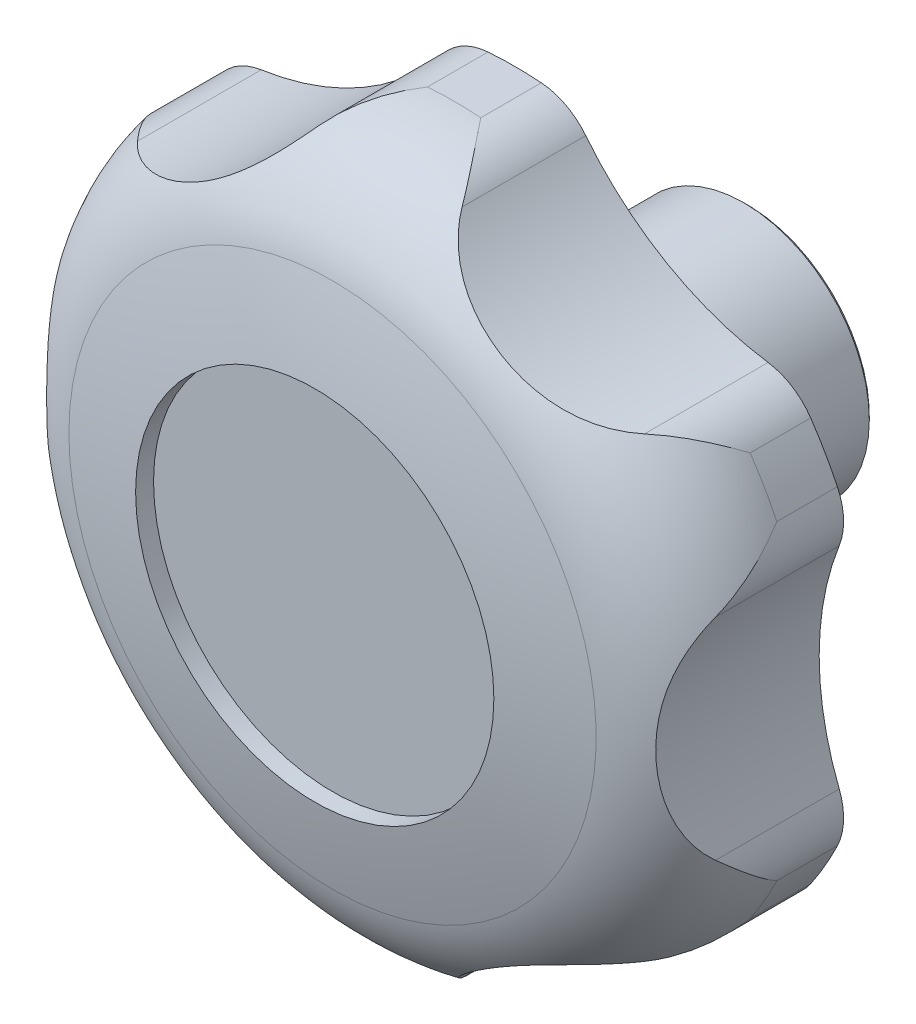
ISO-10303-21;
HEADER;
FILE_DESCRIPTION(('STEP AP214'),'2;1');
FILE_NAME('part.step','',(''),(''),'','','');
FILE_SCHEMA(('AUTOMOTIVE_DESIGN { 1 0 10303 214 1 1 1 1 }'));
ENDSEC;
DATA;
#1=APPLICATION_CONTEXT('core data for automotive mechanical design processes');
#2=APPLICATION_PROTOCOL_DEFINITION('international standard','automotive_design',2000,#1);
#3=PRODUCT_CONTEXT('',#1,'mechanical');
#4=PRODUCT('Part','Part','',(#3));
#5=PRODUCT_RELATED_PRODUCT_CATEGORY('part','',(#4));
#6=PRODUCT_DEFINITION_FORMATION('','',#4);
#7=PRODUCT_DEFINITION_CONTEXT('part definition',#1,'design');
#8=PRODUCT_DEFINITION('design','',#6,#7);
#9=PRODUCT_DEFINITION_SHAPE('','',#8);
#10=(LENGTH_UNIT() NAMED_UNIT(*) SI_UNIT(.MILLI.,.METRE.));
#11=(NAMED_UNIT(*) PLANE_ANGLE_UNIT() SI_UNIT($,.RADIAN.));
#12=(NAMED_UNIT(*) SI_UNIT($,.STERADIAN.) SOLID_ANGLE_UNIT());
#13=UNCERTAINTY_MEASURE_WITH_UNIT(LENGTH_MEASURE(1.E-05),#10,'distance_accuracy_value','');
#14=(GEOMETRIC_REPRESENTATION_CONTEXT(3) GLOBAL_UNCERTAINTY_ASSIGNED_CONTEXT((#13)) GLOBAL_UNIT_ASSIGNED_CONTEXT((#10,
#11,#12)) REPRESENTATION_CONTEXT('',''));
#15=CARTESIAN_POINT('',(0.,0.,0.));
#16=DIRECTION('',(0.,0.,1.));
#17=DIRECTION('',(1.,0.,0.));
#18=AXIS2_PLACEMENT_3D('',#15,#16,#17);
#19=CARTESIAN_POINT('',(0.,0.,35.0080113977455));
#20=DIRECTION('',(0.,0.,1.));
#21=DIRECTION('',(-1.,0.,0.));
#22=AXIS2_PLACEMENT_3D('',#19,#20,#21);
#23=CYLINDRICAL_SURFACE('',#22,20.);
#24=CARTESIAN_POINT('',(0.,0.,13.));
#25=DIRECTION('',(0.,0.,1.));
#26=DIRECTION('',(-1.,0.,0.));
#27=AXIS2_PLACEMENT_3D('',#24,#25,#26);
#28=CIRCLE('',#27,20.);
#29=CARTESIAN_POINT('',(1.4880574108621,19.9445653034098,12.9999999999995));
#30=VERTEX_POINT('',#29);
#31=CARTESIAN_POINT('',(-1.48805741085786,19.94456530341,12.9999999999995));
#32=VERTEX_POINT('',#31);
#33=EDGE_CURVE('E458',#30,#32,#28,.T.);
#34=ORIENTED_EDGE('',*,*,#33,.T.);
#35=DIRECTION('',(0.,0.,1.));
#36=VECTOR('',#35,1.);
#37=CARTESIAN_POINT('',(-1.48805741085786,19.94456530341,-4.9960036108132E-13));
#38=LINE('',#37,#36);
#39=CARTESIAN_POINT('',(-1.48805741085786,19.94456530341,16.38093031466));
#40=VERTEX_POINT('',#39);
#41=EDGE_CURVE('E182',#32,#40,#38,.T.);
#42=ORIENTED_EDGE('',*,*,#41,.T.);
#43=CARTESIAN_POINT('',(0.,0.,16.38093031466));
#44=DIRECTION('',(0.,0.,1.));
#45=DIRECTION('',(-1.,0.,0.));
#46=AXIS2_PLACEMENT_3D('',#43,#44,#45);
#47=CIRCLE('',#46,20.);
#48=CARTESIAN_POINT('',(1.4880574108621,19.9445653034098,16.38093031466));
#49=VERTEX_POINT('',#48);
#50=EDGE_CURVE('E198',#49,#40,#47,.T.);
#51=ORIENTED_EDGE('',*,*,#50,.F.);
#52=DIRECTION('',(0.,0.,1.));
#53=VECTOR('',#52,1.);
#54=CARTESIAN_POINT('',(1.4880574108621,19.9445653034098,-4.9960036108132E-13));
#55=LINE('',#54,#53);
#56=EDGE_CURVE('E577',#30,#49,#55,.T.);
#57=ORIENTED_EDGE('',*,*,#56,.F.);
#58=EDGE_LOOP('',(#34,#42,#51,#57));
#59=FACE_BOUND('',#58,.T.);
#60=ADVANCED_FACE('F14',(#59),#23,.T.);
#61=CARTESIAN_POINT('',(18.0165289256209,8.68358713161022,12.9999999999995));
#62=VERTEX_POINT('',#61);
#63=CARTESIAN_POINT('',(16.5284715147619,11.2609781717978,13.));
#64=VERTEX_POINT('',#63);
#65=EDGE_CURVE('E462',#62,#64,#28,.T.);
#66=ORIENTED_EDGE('',*,*,#65,.T.);
#67=DIRECTION('',(0.,0.,1.));
#68=VECTOR('',#67,1.);
#69=CARTESIAN_POINT('',(16.5284715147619,11.2609781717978,-4.9960036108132E-13));
#70=LINE('',#69,#68);
#71=CARTESIAN_POINT('',(16.5284715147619,11.2609781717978,16.38093031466));
#72=VERTEX_POINT('',#71);
#73=EDGE_CURVE('E490',#64,#72,#70,.T.);
#74=ORIENTED_EDGE('',*,*,#73,.T.);
#75=CARTESIAN_POINT('',(18.0165289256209,8.68358713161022,16.38093031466));
#76=VERTEX_POINT('',#75);
#77=EDGE_CURVE('E552',#76,#72,#47,.T.);
#78=ORIENTED_EDGE('',*,*,#77,.F.);
#79=DIRECTION('',(0.,0.,1.));
#80=VECTOR('',#79,1.);
#81=CARTESIAN_POINT('',(18.0165289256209,8.68358713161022,-4.9960036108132E-13));
#82=LINE('',#81,#80);
#83=EDGE_CURVE('E492',#62,#76,#82,.T.);
#84=ORIENTED_EDGE('',*,*,#83,.F.);
#85=EDGE_LOOP('',(#66,#74,#78,#84));
#86=FACE_BOUND('',#85,.T.);
#87=ADVANCED_FACE('F428',(#86),#23,.T.);
#88=CARTESIAN_POINT('',(16.5284715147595,-11.260978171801,12.9999999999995));
#89=VERTEX_POINT('',#88);
#90=CARTESIAN_POINT('',(18.0165289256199,-8.68358713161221,13.));
#91=VERTEX_POINT('',#90);
#92=EDGE_CURVE('E475',#89,#91,#28,.T.);
#93=ORIENTED_EDGE('',*,*,#92,.T.);
#94=DIRECTION('',(0.,0.,1.));
#95=VECTOR('',#94,1.);
#96=CARTESIAN_POINT('',(18.0165289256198,-8.68358713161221,-4.9960036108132E-13));
#97=LINE('',#96,#95);
#98=CARTESIAN_POINT('',(18.0165289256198,-8.68358713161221,16.38093031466));
#99=VERTEX_POINT('',#98);
#100=EDGE_CURVE('E568',#91,#99,#97,.T.);
#101=ORIENTED_EDGE('',*,*,#100,.T.);
#102=CARTESIAN_POINT('',(16.5284715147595,-11.260978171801,16.38093031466));
#103=VERTEX_POINT('',#102);
#104=EDGE_CURVE('E547',#103,#99,#47,.T.);
#105=ORIENTED_EDGE('',*,*,#104,.F.);
#106=DIRECTION('',(0.,0.,1.));
#107=VECTOR('',#106,1.);
#108=CARTESIAN_POINT('',(16.5284715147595,-11.260978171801,-4.9960036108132E-13));
#109=LINE('',#108,#107);
#110=EDGE_CURVE('E611',#89,#103,#109,.T.);
#111=ORIENTED_EDGE('',*,*,#110,.F.);
#112=EDGE_LOOP('',(#93,#101,#105,#111));
#113=FACE_BOUND('',#112,.T.);
#114=ADVANCED_FACE('F436',(#113),#23,.T.);
#115=CARTESIAN_POINT('',(-1.48805741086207,-19.94456530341,12.9999999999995));
#116=VERTEX_POINT('',#115);
#117=CARTESIAN_POINT('',(1.48805741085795,-19.94456530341,13.));
#118=VERTEX_POINT('',#117);
#119=EDGE_CURVE('E469',#116,#118,#28,.T.);
#120=ORIENTED_EDGE('',*,*,#119,.T.);
#121=DIRECTION('',(0.,0.,1.));
#122=VECTOR('',#121,1.);
#123=CARTESIAN_POINT('',(1.48805741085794,-19.94456530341,-4.9960036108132E-13));
#124=LINE('',#123,#122);
#125=CARTESIAN_POINT('',(1.48805741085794,-19.94456530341,16.38093031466));
#126=VERTEX_POINT('',#125);
#127=EDGE_CURVE('E603',#118,#126,#124,.T.);
#128=ORIENTED_EDGE('',*,*,#127,.T.);
#129=CARTESIAN_POINT('',(-1.48805741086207,-19.94456530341,16.38093031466));
#130=VERTEX_POINT('',#129);
#131=EDGE_CURVE('E542',#130,#126,#47,.T.);
#132=ORIENTED_EDGE('',*,*,#131,.F.);
#133=DIRECTION('',(0.,0.,1.));
#134=VECTOR('',#133,1.);
#135=CARTESIAN_POINT('',(-1.48805741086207,-19.94456530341,-4.9960036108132E-13));
#136=LINE('',#135,#134);
#137=EDGE_CURVE('E601',#116,#130,#136,.T.);
#138=ORIENTED_EDGE('',*,*,#137,.F.);
#139=EDGE_LOOP('',(#120,#128,#132,#138));
#140=FACE_BOUND('',#139,.T.);
#141=ADVANCED_FACE('F448',(#140),#23,.T.);
#142=CARTESIAN_POINT('',(-18.0165289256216,-8.68358713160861,12.9999999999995));
#143=VERTEX_POINT('',#142);
#144=CARTESIAN_POINT('',(-16.528471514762,-11.2609781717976,13.));
#145=VERTEX_POINT('',#144);
#146=EDGE_CURVE('E461',#143,#145,#28,.T.);
#147=ORIENTED_EDGE('',*,*,#146,.T.);
#148=DIRECTION('',(0.,0.,1.));
#149=VECTOR('',#148,1.);
#150=CARTESIAN_POINT('',(-16.5284715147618,-11.2609781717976,-4.9960036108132E-13));
#151=LINE('',#150,#149);
#152=CARTESIAN_POINT('',(-16.5284715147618,-11.2609781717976,16.38093031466));
#153=VERTEX_POINT('',#152);
#154=EDGE_CURVE('E593',#145,#153,#151,.T.);
#155=ORIENTED_EDGE('',*,*,#154,.T.);
#156=CARTESIAN_POINT('',(-18.0165289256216,-8.68358713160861,16.38093031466));
#157=VERTEX_POINT('',#156);
#158=EDGE_CURVE('E473',#157,#153,#47,.T.);
#159=ORIENTED_EDGE('',*,*,#158,.F.);
#160=DIRECTION('',(0.,0.,1.));
#161=VECTOR('',#160,1.);
#162=CARTESIAN_POINT('',(-18.0165289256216,-8.68358713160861,-4.9960036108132E-13));
#163=LINE('',#162,#161);
#164=EDGE_CURVE('E591',#143,#157,#163,.T.);
#165=ORIENTED_EDGE('',*,*,#164,.F.);
#166=EDGE_LOOP('',(#147,#155,#159,#165));
#167=FACE_BOUND('',#166,.T.);
#168=ADVANCED_FACE('F440',(#167),#23,.T.);
#169=CARTESIAN_POINT('',(-16.5284715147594,11.260978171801,12.9999999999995));
#170=VERTEX_POINT('',#169);
#171=CARTESIAN_POINT('',(-18.0165289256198,8.68358713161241,13.));
#172=VERTEX_POINT('',#171);
#173=EDGE_CURVE('E453',#170,#172,#28,.T.);
#174=ORIENTED_EDGE('',*,*,#173,.T.);
#175=DIRECTION('',(0.,0.,1.));
#176=VECTOR('',#175,1.);
#177=CARTESIAN_POINT('',(-18.0165289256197,8.68358713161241,-4.9960036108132E-13));
#178=LINE('',#177,#176);
#179=CARTESIAN_POINT('',(-18.0165289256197,8.68358713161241,16.38093031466));
#180=VERTEX_POINT('',#179);
#181=EDGE_CURVE('E37',#172,#180,#178,.T.);
#182=ORIENTED_EDGE('',*,*,#181,.T.);
#183=CARTESIAN_POINT('',(-16.5284715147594,11.260978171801,16.38093031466));
#184=VERTEX_POINT('',#183);
#185=EDGE_CURVE('E468',#184,#180,#47,.T.);
#186=ORIENTED_EDGE('',*,*,#185,.F.);
#187=DIRECTION('',(0.,0.,1.));
#188=VECTOR('',#187,1.);
#189=CARTESIAN_POINT('',(-16.5284715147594,11.260978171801,-4.9960036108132E-13));
#190=LINE('',#189,#188);
#191=EDGE_CURVE('E456',#170,#184,#190,.T.);
#192=ORIENTED_EDGE('',*,*,#191,.F.);
#193=EDGE_LOOP('',(#174,#182,#186,#192));
#194=FACE_BOUND('',#193,.T.);
#195=ADVANCED_FACE('F430',(#194),#23,.T.);
#196=CARTESIAN_POINT('',(0.,0.,-35.0000000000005));
#197=DIRECTION('',(-1.,0.,0.));
#198=DIRECTION('',(0.,0.,-1.));
#199=AXIS2_PLACEMENT_3D('',#196,#197,#198);
#200=SPHERICAL_SURFACE('',#199,60.);
#201=CARTESIAN_POINT('',(0.,0.,-35.0000000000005));
#202=DIRECTION('',(0.,0.,1.));
#203=DIRECTION('',(-1.,0.,0.));
#204=AXIS2_PLACEMENT_3D('',#201,#202,#203);
#205=SPHERICAL_SURFACE('',#204,60.);
#206=CARTESIAN_POINT('',(0.,0.,23.167090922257));
#207=DIRECTION('',(0.,0.,1.));
#208=DIRECTION('',(-1.,0.,0.));
#209=AXIS2_PLACEMENT_3D('',#206,#207,#208);
#210=CIRCLE('',#209,14.7169811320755);
#211=CARTESIAN_POINT('',(-14.7169811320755,0.,23.167090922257));
#212=VERTEX_POINT('',#211);
#213=EDGE_CURVE('E539',#212,#212,#210,.T.);
#214=ORIENTED_EDGE('',*,*,#213,.T.);
#215=EDGE_LOOP('',(#214));
#216=FACE_BOUND('',#215,.T.);
#217=CARTESIAN_POINT('',(0.,0.,24.160797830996));
#218=DIRECTION('',(0.,0.,1.));
#219=DIRECTION('',(-1.,0.,0.));
#220=AXIS2_PLACEMENT_3D('',#217,#218,#219);
#221=CIRCLE('',#220,10.);
#222=CARTESIAN_POINT('',(-10.,0.,24.160797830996));
#223=VERTEX_POINT('',#222);
#224=EDGE_CURVE('E199',#223,#223,#221,.T.);
#225=ORIENTED_EDGE('',*,*,#224,.F.);
#226=EDGE_LOOP('',(#225));
#227=FACE_BOUND('',#226,.T.);
#228=ADVANCED_FACE('F16',(#216,#227),#205,.T.);
#229=CARTESIAN_POINT('',(0.,0.,16.38093031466));
#230=DIRECTION('',(0.,0.,1.));
#231=DIRECTION('',(-1.,0.,0.));
#232=AXIS2_PLACEMENT_3D('',#229,#230,#231);
#233=TOROIDAL_SURFACE('',#232,13.,7.);
#234=CARTESIAN_POINT('',(1.48805741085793,19.94456530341,16.38093031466));
#235=CARTESIAN_POINT('',(1.49147422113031,19.9443103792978,16.3853314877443));
#236=CARTESIAN_POINT('',(1.49489072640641,19.9440504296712,16.389732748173));
#237=CARTESIAN_POINT('',(1.81379375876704,19.9193149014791,16.8006005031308));
#238=CARTESIAN_POINT('',(2.12658065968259,19.8519874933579,17.2077752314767));
#239=CARTESIAN_POINT('',(2.72890668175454,19.6321878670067,18.0173039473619));
#240=CARTESIAN_POINT('',(3.01841511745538,19.4796053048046,18.4196509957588));
#241=CARTESIAN_POINT('',(3.4111136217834,19.1940432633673,19.0006622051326));
#242=CARTESIAN_POINT('',(3.53138560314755,19.0939385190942,19.1842811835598));
#243=CARTESIAN_POINT('',(3.759784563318,18.875652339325,19.5475677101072));
#244=CARTESIAN_POINT('',(3.86793749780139,18.7575108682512,19.7272430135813));
#245=CARTESIAN_POINT('',(3.96899762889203,18.6302715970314,19.9047576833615));
#246=B_SPLINE_CURVE_WITH_KNOTS('',3,(#234,#235,#236,#237,#238,#239,#240,#241,#242,#243,#244,
#245),.UNSPECIFIED.,.F.,.F.,(4,2,2,2,2,4),(0.,0.0167332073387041,1.56205380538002,
3.1093791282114,3.83223807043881,4.55351799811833),.UNSPECIFIED.);
#247=CARTESIAN_POINT('',(3.96883886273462,18.6304715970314,19.9044786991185));
#248=VERTEX_POINT('',#247);
#249=EDGE_CURVE('E200',#49,#248,#246,.T.);
#250=ORIENTED_EDGE('',*,*,#249,.F.);
#251=ORIENTED_EDGE('',*,*,#50,.T.);
#252=CARTESIAN_POINT('',(-3.96899762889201,18.6302715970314,19.9047576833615));
#253=CARTESIAN_POINT('',(-3.87488306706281,18.7487894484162,19.7394301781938));
#254=CARTESIAN_POINT('',(-3.77455997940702,18.8594451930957,19.5721519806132));
#255=CARTESIAN_POINT('',(-3.56354943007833,19.0648747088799,19.234567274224));
#256=CARTESIAN_POINT('',(-3.45286825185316,19.1596580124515,19.0642626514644));
#257=CARTESIAN_POINT('',(-3.22337066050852,19.3331052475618,18.7217368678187));
#258=CARTESIAN_POINT('',(-3.10457584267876,19.4118099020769,18.5495217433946));
#259=CARTESIAN_POINT('',(-2.86030415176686,19.5533565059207,18.2033602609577));
#260=CARTESIAN_POINT('',(-2.73482744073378,19.6161988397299,18.0294139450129));
#261=CARTESIAN_POINT('',(-2.42924956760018,19.7472078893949,17.6128190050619));
#262=CARTESIAN_POINT('',(-2.24677265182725,19.8080525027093,17.3695899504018));
#263=CARTESIAN_POINT('',(-1.87597960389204,19.8989790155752,16.8822329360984));
#264=CARTESIAN_POINT('',(-1.68767071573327,19.9290976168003,16.638106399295));
#265=CARTESIAN_POINT('',(-1.49489075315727,19.9440504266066,16.3897327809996));
#266=CARTESIAN_POINT('',(-1.49147424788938,19.9443103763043,16.385331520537));
#267=CARTESIAN_POINT('',(-1.4880574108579,19.94456530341,16.38093031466));
#268=B_SPLINE_CURVE_WITH_KNOTS('',3,(#252,#253,#254,#255,#256,#257,#258,#259,#260,#261,#262,
#263,#264,#265,#266,#267),.UNSPECIFIED.,.F.,.F.,(4,2,2,2,2,2,2,4),(0.,0.672016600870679,
1.34362815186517,2.01351700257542,2.68338961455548,3.61205098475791,4.53960178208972,
4.55633498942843),.UNSPECIFIED.);
#269=CARTESIAN_POINT('',(-3.96883886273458,18.6304715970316,19.9044786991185));
#270=VERTEX_POINT('',#269);
#271=EDGE_CURVE('E186',#270,#40,#268,.T.);
#272=ORIENTED_EDGE('',*,*,#271,.F.);
#273=CARTESIAN_POINT('',(-3.96868008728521,18.6306715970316,19.9041996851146));
#274=CARTESIAN_POINT('',(-4.04437009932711,18.5352984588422,20.0373324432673));
#275=CARTESIAN_POINT('',(-4.12526413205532,18.4356613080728,20.1643450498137));
#276=CARTESIAN_POINT('',(-4.29682494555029,18.2299121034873,20.4055808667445));
#277=CARTESIAN_POINT('',(-4.38747947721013,18.1238082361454,20.5198197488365));
#278=CARTESIAN_POINT('',(-4.57713747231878,17.9080462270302,20.734184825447));
#279=CARTESIAN_POINT('',(-4.67604562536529,17.7984357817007,20.8344439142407));
#280=CARTESIAN_POINT('',(-4.88238077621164,17.5763891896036,21.0223145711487));
#281=CARTESIAN_POINT('',(-4.98981004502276,17.4639522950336,21.1099227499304));
#282=CARTESIAN_POINT('',(-5.21195811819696,17.2384215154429,21.2724206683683));
#283=CARTESIAN_POINT('',(-5.32664134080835,17.1253329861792,21.3473667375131));
#284=CARTESIAN_POINT('',(-5.5630216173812,16.8994018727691,21.4855727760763));
#285=CARTESIAN_POINT('',(-5.68471815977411,16.7865592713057,21.5488335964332));
#286=CARTESIAN_POINT('',(-5.93480326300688,16.5619776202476,21.6645190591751));
#287=CARTESIAN_POINT('',(-6.06320974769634,16.4502425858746,21.7169126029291));
#288=CARTESIAN_POINT('',(-6.32576627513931,16.2291643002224,21.8113760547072));
#289=CARTESIAN_POINT('',(-6.45991755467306,16.1198215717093,21.8534437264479));
#290=CARTESIAN_POINT('',(-6.79339160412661,15.8570291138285,21.9443164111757));
#291=CARTESIAN_POINT('',(-6.99547686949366,15.7052831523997,21.9879752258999));
#292=CARTESIAN_POINT('',(-7.40871955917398,15.410195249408,22.0571569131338));
#293=CARTESIAN_POINT('',(-7.61988028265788,15.2668564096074,22.0826731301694));
#294=CARTESIAN_POINT('',(-8.05020035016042,14.9896326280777,22.1167506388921));
#295=CARTESIAN_POINT('',(-8.26937403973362,14.8557660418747,22.1252798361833));
#296=CARTESIAN_POINT('',(-8.71390124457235,14.59876043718,22.1256982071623));
#297=CARTESIAN_POINT('',(-8.93925403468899,14.4756201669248,22.1175893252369));
#298=CARTESIAN_POINT('',(-9.3969107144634,14.2396244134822,22.0841784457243));
#299=CARTESIAN_POINT('',(-9.62926146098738,14.1268834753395,22.0587061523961));
#300=CARTESIAN_POINT('',(-10.0969036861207,13.9136966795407,21.9891901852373));
#301=CARTESIAN_POINT('',(-10.3321956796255,13.8132530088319,21.9451432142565));
#302=CARTESIAN_POINT('',(-10.8026152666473,13.6254517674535,21.8367845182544));
#303=CARTESIAN_POINT('',(-11.0377415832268,13.5380595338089,21.7725279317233));
#304=CARTESIAN_POINT('',(-11.5052304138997,13.37642671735,21.6215210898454));
#305=CARTESIAN_POINT('',(-11.7375946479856,13.3021775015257,21.5347856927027));
#306=CARTESIAN_POINT('',(-12.1176745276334,13.1898767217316,21.3703811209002));
#307=CARTESIAN_POINT('',(-12.2673166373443,13.1480997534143,21.2996511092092));
#308=CARTESIAN_POINT('',(-12.5622706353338,13.0702110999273,21.1469698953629));
#309=CARTESIAN_POINT('',(-12.707583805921,13.0340977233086,21.0650220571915));
#310=CARTESIAN_POINT('',(-12.9920623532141,12.967442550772,20.8897703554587));
#311=CARTESIAN_POINT('',(-13.1312411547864,12.9368880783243,20.7964931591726));
#312=CARTESIAN_POINT('',(-13.4021505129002,12.880989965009,20.5983767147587));
#313=CARTESIAN_POINT('',(-13.5338850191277,12.8556435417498,20.4935436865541));
#314=CARTESIAN_POINT('',(-13.7470664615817,12.817207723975,20.3083350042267));
#315=CARTESIAN_POINT('',(-13.8309740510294,12.8028082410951,20.2310445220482));
#316=CARTESIAN_POINT('',(-13.9941817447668,12.7760624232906,20.0714083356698));
#317=CARTESIAN_POINT('',(-14.0734817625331,12.7637161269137,19.9890625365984));
#318=CARTESIAN_POINT('',(-14.1502422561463,12.7523213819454,19.9042577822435));
#319=B_SPLINE_CURVE_WITH_KNOTS('',3,(#273,#274,#275,#276,#277,#278,#279,#280,#281,#282,#283,
#284,#285,#286,#287,#288,#289,#290,#291,#292,#293,#294,#295,#296,#297,#298,#299,#300,#301,#302,
#303,#304,#305,#306,#307,#308,#309,#310,#311,#312,#313,#314,#315,#316,#317,#318),.UNSPECIFIED.,
.F.,.F.,(4,2,2,2,2,2,2,2,2,2,2,2,2,2,2,2,2,2,2,2,2,2,4),(0.,0.540904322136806,1.08113756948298,
1.61582234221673,2.15065009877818,2.68303208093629,3.21537527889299,3.7492214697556,
4.28318317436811,5.05149336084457,5.82008525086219,6.5901279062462,7.36008057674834,
8.13769549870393,8.91544851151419,9.69109770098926,10.4662354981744,10.9779030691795,
11.4894175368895,11.9997505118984,12.5098101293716,12.8545587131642,13.1993137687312),.UNSPECIFIED.);
#320=CARTESIAN_POINT('',(-14.1500422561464,12.7523510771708,19.9044786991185));
#321=VERTEX_POINT('',#320);
#322=EDGE_CURVE('E174',#270,#321,#319,.T.);
#323=ORIENTED_EDGE('',*,*,#322,.T.);
#324=CARTESIAN_POINT('',(-16.5284715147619,11.2609781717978,16.38093031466));
#325=CARTESIAN_POINT('',(-16.526542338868,11.2638097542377,16.3853314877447));
#326=CARTESIAN_POINT('',(-16.5246089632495,11.2666385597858,16.3897327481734));
#327=CARTESIAN_POINT('',(-16.3437358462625,11.5304489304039,16.8006005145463));
#328=CARTESIAN_POINT('',(-16.1290351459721,11.7676666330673,17.2077752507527));
#329=CARTESIAN_POINT('',(-15.6375200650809,12.1793964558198,18.0173039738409));
#330=CARTESIAN_POINT('',(-15.3606254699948,12.3538268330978,18.4196510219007));
#331=CARTESIAN_POINT('',(-14.9169799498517,12.5511292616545,19.0006521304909));
#332=CARTESIAN_POINT('',(-14.7701590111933,12.6052330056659,19.1842611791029));
#333=CARTESIAN_POINT('',(-14.4669357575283,12.6938865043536,19.5475282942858));
#334=CARTESIAN_POINT('',(-14.3105550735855,12.7284787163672,19.72719411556));
#335=CARTESIAN_POINT('',(-14.1498422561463,12.7523807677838,19.9046996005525));
#336=B_SPLINE_CURVE_WITH_KNOTS('',3,(#324,#325,#326,#327,#328,#329,#330,#331,#332,#333,#334,
#335),.UNSPECIFIED.,.F.,.F.,(4,2,2,2,2,4),(0.,0.0167332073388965,1.56205384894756,
3.10937912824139,3.83219873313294,4.5534393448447),.UNSPECIFIED.);
#337=EDGE_CURVE('E181',#184,#321,#336,.T.);
#338=ORIENTED_EDGE('',*,*,#337,.F.);
#339=ORIENTED_EDGE('',*,*,#185,.T.);
#340=CARTESIAN_POINT('',(-18.1188021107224,5.8779205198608,19.904713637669));
#341=CARTESIAN_POINT('',(-18.1743828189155,6.01868604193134,19.7393849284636));
#342=CARTESIAN_POINT('',(-18.2200504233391,6.16089717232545,19.5721055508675));
#343=CARTESIAN_POINT('',(-18.2924491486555,6.44635409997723,19.2345185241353));
#344=CARTESIAN_POINT('',(-18.3191916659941,6.58959922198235,19.0642127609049));
#345=CARTESIAN_POINT('',(-18.354649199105,6.87507491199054,18.7216847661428));
#346=CARTESIAN_POINT('',(-18.3634102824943,7.01730713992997,18.5494685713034));
#347=CARTESIAN_POINT('',(-18.3638538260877,7.2996268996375,18.2033049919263));
#348=CARTESIAN_POINT('',(-18.3555367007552,7.43971448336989,18.029357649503));
#349=CARTESIAN_POINT('',(-18.3162014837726,7.76984941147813,17.6127710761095));
#350=CARTESIAN_POINT('',(-18.2776557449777,7.95829337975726,17.3695515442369));
#351=CARTESIAN_POINT('',(-18.1710057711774,8.32485756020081,16.8822136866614));
#352=CARTESIAN_POINT('',(-18.1029369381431,8.50298984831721,16.638096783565));
#353=CARTESIAN_POINT('',(-18.0194997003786,8.67741184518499,16.3897327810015));
#354=CARTESIAN_POINT('',(-18.0180165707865,8.68050060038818,16.3853315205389));
#355=CARTESIAN_POINT('',(-18.0165289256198,8.68358713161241,16.38093031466));
#356=B_SPLINE_CURVE_WITH_KNOTS('',3,(#340,#341,#342,#343,#344,#345,#346,#347,#348,#349,#350,
#351,#352,#353,#354,#355),.UNSPECIFIED.,.F.,.F.,(4,2,2,2,2,2,2,4),(0.,0.672020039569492,
1.34363505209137,2.01352725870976,2.68340320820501,3.61202792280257,4.539542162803,
4.55627537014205),.UNSPECIFIED.);
#357=CARTESIAN_POINT('',(-18.118881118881,5.87812051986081,19.9044786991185));
#358=VERTEX_POINT('',#357);
#359=EDGE_CURVE('E248',#358,#180,#356,.T.);
#360=ORIENTED_EDGE('',*,*,#359,.F.);
#361=CARTESIAN_POINT('',(-18.1189601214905,5.87832051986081,19.9042437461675));
#362=CARTESIAN_POINT('',(-18.0742090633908,5.76508237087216,20.0373759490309));
#363=CARTESIAN_POINT('',(-18.0283673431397,5.64520539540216,20.1643878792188));
#364=CARTESIAN_POINT('',(-17.9359630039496,5.39375057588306,20.4056221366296));
#365=CARTESIAN_POINT('',(-17.8894013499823,5.2621874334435,20.5198601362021));
#366=CARTESIAN_POINT('',(-17.7973745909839,4.99005371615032,20.7342232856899));
#367=CARTESIAN_POINT('',(-17.7519031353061,4.84958953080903,20.8344813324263));
#368=CARTESIAN_POINT('',(-17.6627726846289,4.55987085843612,21.0223497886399));
#369=CARTESIAN_POINT('',(-17.619114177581,4.41061403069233,21.1099568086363));
#370=CARTESIAN_POINT('',(-17.5348731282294,4.10545908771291,21.2724523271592));
#371=CARTESIAN_POINT('',(-17.4942774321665,3.94959446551,21.3473971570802));
#372=CARTESIAN_POINT('',(-17.4168061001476,3.63191414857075,21.4856006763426));
#373=CARTESIAN_POINT('',(-17.3799301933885,3.47009888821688,21.54886021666));
#374=CARTESIAN_POINT('',(-17.3104802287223,3.14122478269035,21.6645431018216));
#375=CARTESIAN_POINT('',(-17.2779186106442,2.97415242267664,21.7169353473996));
#376=CARTESIAN_POINT('',(-17.2177386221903,2.63622963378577,21.8113961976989));
#377=CARTESIAN_POINT('',(-17.1901213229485,2.46537839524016,21.8534625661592));
#378=CARTESIAN_POINT('',(-17.1292751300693,2.0451819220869,21.9443320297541));
#379=CARTESIAN_POINT('',(-17.098903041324,1.79429623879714,21.9879889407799));
#380=CARTESIAN_POINT('',(-17.0499732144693,1.2888703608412,22.0571668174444));
#381=CARTESIAN_POINT('',(-17.0314198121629,1.03432885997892,22.0826811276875));
#382=CARTESIAN_POINT('',(-17.0064997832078,0.523045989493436,22.1167547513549));
#383=CARTESIAN_POINT('',(-17.0001562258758,0.266301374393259,22.1252819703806));
#384=CARTESIAN_POINT('',(-16.9998494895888,-0.247175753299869,22.125696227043));
#385=CARTESIAN_POINT('',(-17.0058848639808,-0.503908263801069,22.1175852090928));
#386=CARTESIAN_POINT('',(-17.0303381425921,-1.01825026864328,22.0841697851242));
#387=CARTESIAN_POINT('',(-17.0488786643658,-1.27584306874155,22.0586950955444));
#388=CARTESIAN_POINT('',(-17.098077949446,-1.78742757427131,21.9891739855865));
#389=CARTESIAN_POINT('',(-17.128738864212,-2.04141863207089,21.9451242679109));
#390=CARTESIAN_POINT('',(-17.2013113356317,-2.54271489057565,21.8367596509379));
#391=CARTESIAN_POINT('',(-17.2431922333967,-2.79003631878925,21.7724998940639));
#392=CARTESIAN_POINT('',(-17.3369616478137,-3.27570930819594,21.6214862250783));
#393=CARTESIAN_POINT('',(-17.3888435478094,-3.51406667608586,21.5347471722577));
#394=CARTESIAN_POINT('',(-17.4816300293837,-3.89937284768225,21.3703368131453));
#395=CARTESIAN_POINT('',(-17.5202715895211,-4.04985295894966,21.2996049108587));
#396=CARTESIAN_POINT('',(-17.6002956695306,-4.34423029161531,21.1469199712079));
#397=CARTESIAN_POINT('',(-17.6416773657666,-4.48812946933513,21.0649702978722));
#398=CARTESIAN_POINT('',(-17.7261917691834,-4.76781773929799,20.8897150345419));
#399=CARTESIAN_POINT('',(-17.769320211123,-4.90362479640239,20.7964361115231));
#400=CARTESIAN_POINT('',(-17.8563654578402,-5.16618299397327,20.5983163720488));
#401=CARTESIAN_POINT('',(-17.9002818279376,-5.29293894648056,20.4934817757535));
#402=CARTESIAN_POINT('',(-17.9735824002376,-5.49676399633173,20.3082786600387));
#403=CARTESIAN_POINT('',(-18.0030624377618,-5.57661965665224,20.2309958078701));
#404=CARTESIAN_POINT('',(-18.0614968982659,-5.73131526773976,20.0713760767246));
#405=CARTESIAN_POINT('',(-18.0904513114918,-5.80615512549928,19.9890391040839));
#406=CARTESIAN_POINT('',(-18.1189601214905,-5.87832051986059,19.9042437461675));
#407=B_SPLINE_CURVE_WITH_KNOTS('',3,(#361,#362,#363,#364,#365,#366,#367,#368,#369,#370,#371,
#372,#373,#374,#375,#376,#377,#378,#379,#380,#381,#382,#383,#384,#385,#386,#387,#388,#389,#390,
#391,#392,#393,#394,#395,#396,#397,#398,#399,#400,#401,#402,#403,#404,#405,#406),.UNSPECIFIED.,
.F.,.F.,(4,2,2,2,2,2,2,2,2,2,2,2,2,2,2,2,2,2,2,2,2,2,4),(0.,0.54090742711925,1.08114375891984,
1.61583154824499,2.15066232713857,2.68304725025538,3.21539338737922,3.74924255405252,
4.28320723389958,5.05152112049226,5.82011670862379,6.59016306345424,7.36011943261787,
8.13773742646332,8.91549351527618,9.6911456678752,10.466286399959,10.9779506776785,
11.489461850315,11.9997915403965,12.5098478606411,12.8545572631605,13.1992730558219),.UNSPECIFIED.);
#408=CARTESIAN_POINT('',(-18.118881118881,-5.87812051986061,19.9044786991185));
#409=VERTEX_POINT('',#408);
#410=EDGE_CURVE('E254',#358,#409,#407,.T.);
#411=ORIENTED_EDGE('',*,*,#410,.T.);
#412=CARTESIAN_POINT('',(-18.0165289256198,-8.68358713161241,16.38093031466));
#413=CARTESIAN_POINT('',(-18.0180165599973,-8.68050062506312,16.3853314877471));
#414=CARTESIAN_POINT('',(-18.0194996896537,-8.67741186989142,16.3897327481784));
#415=CARTESIAN_POINT('',(-18.1575296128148,-8.38886597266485,16.8006005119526));
#416=CARTESIAN_POINT('',(-18.2556158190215,-8.0843208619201,17.2077752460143));
#417=CARTESIAN_POINT('',(-18.3664267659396,-7.45279140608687,18.0173039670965));
#418=CARTESIAN_POINT('',(-18.3790406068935,-7.12577846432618,18.419651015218));
#419=CARTESIAN_POINT('',(-18.3280865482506,-6.6429169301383,19.0006545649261));
#420=CARTESIAN_POINT('',(-18.3015308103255,-6.48871235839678,19.1842660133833));
#421=CARTESIAN_POINT('',(-18.2266938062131,-6.18178255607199,19.5475378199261));
#422=CARTESIAN_POINT('',(-18.1784601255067,-6.02905482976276,19.7272059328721));
#423=CARTESIAN_POINT('',(-18.1188021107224,-5.87792051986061,19.904713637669));
#424=B_SPLINE_CURVE_WITH_KNOTS('',3,(#412,#413,#414,#415,#416,#417,#418,#419,#420,#421,#422,
#423),.UNSPECIFIED.,.F.,.F.,(4,2,2,2,2,4),(0.,0.0167332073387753,1.56205383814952,
3.10937912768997,3.83220823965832,4.55345835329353),.UNSPECIFIED.);
#425=EDGE_CURVE('E276',#157,#409,#424,.T.);
#426=ORIENTED_EDGE('',*,*,#425,.F.);
#427=ORIENTED_EDGE('',*,*,#158,.T.);
#428=CARTESIAN_POINT('',(-14.1498422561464,-12.7523807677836,19.9046996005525));
#429=CARTESIAN_POINT('',(-14.2995391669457,-12.7301317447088,19.7393705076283));
#430=CARTESIAN_POINT('',(-14.4455314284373,-12.6985749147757,19.5720907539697));
#431=CARTESIAN_POINT('',(-14.7289436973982,-12.6185444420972,19.2345029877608));
#432=CARTESIAN_POINT('',(-14.8663688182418,-12.5700810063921,19.0641968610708));
#433=CARTESIAN_POINT('',(-15.1313266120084,-12.4580491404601,18.7216681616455));
#434=CARTESIAN_POINT('',(-15.2588837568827,-12.3945197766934,18.549451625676));
#435=CARTESIAN_POINT('',(-15.5036013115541,-12.2537428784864,18.2032873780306));
#436=CARTESIAN_POINT('',(-15.6207619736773,-12.1764956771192,18.0293397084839));
#437=CARTESIAN_POINT('',(-15.8869968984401,-11.9773632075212,17.6127558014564));
#438=CARTESIAN_POINT('',(-16.0309190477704,-11.8497608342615,17.3695393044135));
#439=CARTESIAN_POINT('',(-16.2950440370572,-11.5741201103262,16.8822075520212));
#440=CARTESIAN_POINT('',(-16.4152750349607,-11.4261063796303,16.6380937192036));
#441=CARTESIAN_POINT('',(-16.524608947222,-11.2666385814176,16.3897327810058));
#442=CARTESIAN_POINT('',(-16.5265423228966,-11.2638097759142,16.3853315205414));
#443=CARTESIAN_POINT('',(-16.5284715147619,-11.2609781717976,16.38093031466));
#444=B_SPLINE_CURVE_WITH_KNOTS('',3,(#428,#429,#430,#431,#432,#433,#434,#435,#436,#437,#438,
#439,#440,#441,#442,#443),.UNSPECIFIED.,.F.,.F.,(4,2,2,2,2,2,2,4),(0.,0.67202113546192,
1.34363725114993,2.01353052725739,2.68340754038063,3.61202057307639,4.53952316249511,
4.55625636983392),.UNSPECIFIED.);
#445=CARTESIAN_POINT('',(-14.1500422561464,-12.752351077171,19.9044786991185));
#446=VERTEX_POINT('',#445);
#447=EDGE_CURVE('E282',#446,#153,#444,.T.);
#448=ORIENTED_EDGE('',*,*,#447,.F.);
#449=CARTESIAN_POINT('',(-14.1502422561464,-12.7523213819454,19.9042577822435));
#450=CARTESIAN_POINT('',(-14.0297989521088,-12.7701850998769,20.0373898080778));
#451=CARTESIAN_POINT('',(-13.903060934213,-12.790423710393,20.1644015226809));
#452=CARTESIAN_POINT('',(-13.6390912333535,-12.8361270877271,20.4056352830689));
#453=CARTESIAN_POINT('',(-13.5018727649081,-12.8615853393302,20.519873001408));
#454=CARTESIAN_POINT('',(-13.2201834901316,-12.917955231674,20.7342355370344));
#455=CARTESIAN_POINT('',(-13.075801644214,-12.9488081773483,20.8344932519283));
#456=CARTESIAN_POINT('',(-12.7803316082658,-13.0164788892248,21.0223610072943));
#457=CARTESIAN_POINT('',(-12.6292416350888,-13.0532982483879,21.1099676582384));
#458=CARTESIAN_POINT('',(-12.3228482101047,-13.1329214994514,21.2724624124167));
#459=CARTESIAN_POINT('',(-12.1675671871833,-13.1756972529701,21.3474068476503));
#460=CARTESIAN_POINT('',(-11.8537114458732,-13.2674459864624,21.4856095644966));
#461=CARTESIAN_POINT('',(-11.6951369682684,-13.3164185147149,21.5488686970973));
#462=CARTESIAN_POINT('',(-11.3755979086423,-13.420710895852,21.6645507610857));
#463=CARTESIAN_POINT('',(-11.2146278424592,-13.476048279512,21.7169425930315));
#464=CARTESIAN_POINT('',(-10.8918874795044,-13.5928930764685,21.8114026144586));
#465=CARTESIAN_POINT('',(-10.7301170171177,-13.6544018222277,21.8534685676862));
#466=CARTESIAN_POINT('',(-10.3357924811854,-13.8118067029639,21.9443370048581));
#467=CARTESIAN_POINT('',(-10.1033327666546,-13.9109471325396,21.9879933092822));
#468=CARTESIAN_POINT('',(-9.64115569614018,-14.1212867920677,22.05716997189));
#469=CARTESIAN_POINT('',(-9.41143937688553,-14.2324904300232,22.0826836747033));
#470=CARTESIAN_POINT('',(-8.95619505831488,-14.4665517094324,22.1167560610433));
#471=CARTESIAN_POINT('',(-8.73067578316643,-14.5894309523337,22.1252826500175));
#472=CARTESIAN_POINT('',(-8.28583797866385,-14.8459051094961,22.1256955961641));
#473=CARTESIAN_POINT('',(-8.06651872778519,-14.9794987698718,22.1175838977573));
#474=CARTESIAN_POINT('',(-7.63331213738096,-15.2578481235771,22.0841670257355));
#475=CARTESIAN_POINT('',(-7.41950056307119,-15.4027016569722,22.0586915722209));
#476=CARTESIAN_POINT('',(-7.00105526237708,-15.7011028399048,21.989168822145));
#477=CARTESIAN_POINT('',(-6.79642317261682,-15.8546520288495,21.94511822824));
#478=CARTESIAN_POINT('',(-6.39857455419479,-16.1681507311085,21.8367517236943));
#479=CARTESIAN_POINT('',(-6.20532864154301,-16.3280818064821,21.7724909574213));
#480=CARTESIAN_POINT('',(-5.83160887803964,-16.6521257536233,21.6214751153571));
#481=CARTESIAN_POINT('',(-5.65112668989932,-16.81623579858,21.5347348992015));
#482=CARTESIAN_POINT('',(-5.36383637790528,-17.0892441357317,21.3703228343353));
#483=CARTESIAN_POINT('',(-5.25283846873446,-17.1979482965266,21.2995904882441));
#484=CARTESIAN_POINT('',(-5.03791406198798,-17.4144388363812,21.1469047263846));
#485=CARTESIAN_POINT('',(-4.93398545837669,-17.522225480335,21.0649546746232));
#486=CARTESIAN_POINT('',(-4.73402726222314,-17.7352600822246,20.8896987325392));
#487=CARTESIAN_POINT('',(-4.63797997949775,-17.8405133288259,20.7964195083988));
#488=CARTESIAN_POINT('',(-4.45412221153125,-18.0471745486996,20.5982992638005));
#489=CARTESIAN_POINT('',(-4.36630734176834,-18.1485845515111,20.4934644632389));
#490=CARTESIAN_POINT('',(-4.22643837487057,-18.3139795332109,20.3082572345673));
#491=CARTESIAN_POINT('',(-4.17201918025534,-18.3794406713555,20.230970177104));
#492=CARTESIAN_POINT('',(-4.06726211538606,-18.5073995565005,20.0713415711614));
#493=CARTESIAN_POINT('',(-4.0169243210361,-18.5698972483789,19.9889999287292));
#494=CARTESIAN_POINT('',(-3.96868008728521,-18.6306715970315,19.9041996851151));
#495=B_SPLINE_CURVE_WITH_KNOTS('',3,(#449,#450,#451,#452,#453,#454,#455,#456,#457,#458,#459,
#460,#461,#462,#463,#464,#465,#466,#467,#468,#469,#470,#471,#472,#473,#474,#475,#476,#477,#478,
#479,#480,#481,#482,#483,#484,#485,#486,#487,#488,#489,#490,#491,#492,#493,#494),.UNSPECIFIED.,
.F.,.F.,(4,2,2,2,2,2,2,2,2,2,2,2,2,2,2,2,2,2,2,2,2,2,4),(0.,0.540908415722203,1.0811457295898,
1.61583448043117,2.15066622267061,2.68305208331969,3.21539915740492,3.74924927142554,
4.28321489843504,5.05152996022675,5.82012672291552,6.59017425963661,7.36013181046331,
8.13775079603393,8.91550787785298,9.69116096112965,10.4663026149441,10.9779647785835,
11.4894738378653,11.9998014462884,12.5098556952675,12.8545815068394,13.199313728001),.UNSPECIFIED.);
#496=CARTESIAN_POINT('',(-3.96883886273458,-18.6304715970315,19.9044786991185));
#497=VERTEX_POINT('',#496);
#498=EDGE_CURVE('E288',#446,#497,#495,.T.);
#499=ORIENTED_EDGE('',*,*,#498,.T.);
#500=CARTESIAN_POINT('',(-1.48805741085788,-19.94456530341,16.38093031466));
#501=CARTESIAN_POINT('',(-1.49147422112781,-19.944310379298,16.3853314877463));
#502=CARTESIAN_POINT('',(-1.4948907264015,-19.9440504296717,16.389732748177));
#503=CARTESIAN_POINT('',(-1.81379375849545,-19.9193149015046,16.8006005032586));
#504=CARTESIAN_POINT('',(-2.12658065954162,-19.8519874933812,17.2077752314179));
#505=CARTESIAN_POINT('',(-2.72890668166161,-19.6321878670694,18.017303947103));
#506=CARTESIAN_POINT('',(-3.01841511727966,-19.4796053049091,18.4196509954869));
#507=CARTESIAN_POINT('',(-3.41111362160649,-19.1940432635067,19.0006622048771));
#508=CARTESIAN_POINT('',(-3.53138560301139,-19.0939385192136,19.1842811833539));
#509=CARTESIAN_POINT('',(-3.7597845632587,-18.8756523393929,19.5475677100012));
#510=CARTESIAN_POINT('',(-3.86793749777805,-18.7575108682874,19.7272430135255));
#511=CARTESIAN_POINT('',(-3.96899762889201,-18.6302715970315,19.9047576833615));
#512=B_SPLINE_CURVE_WITH_KNOTS('',3,(#500,#501,#502,#503,#504,#505,#506,#507,#508,#509,#510,
#511),.UNSPECIFIED.,.F.,.F.,(4,2,2,2,2,4),(0.,0.0167332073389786,1.56205380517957,
3.10937912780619,3.83223807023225,4.5535179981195),.UNSPECIFIED.);
#513=EDGE_CURVE('E295',#130,#497,#512,.T.);
#514=ORIENTED_EDGE('',*,*,#513,.F.);
#515=ORIENTED_EDGE('',*,*,#131,.T.);
#516=CARTESIAN_POINT('',(3.96899762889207,-18.6302715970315,19.9047576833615));
#517=CARTESIAN_POINT('',(3.87488306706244,-18.7487894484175,19.7394301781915));
#518=CARTESIAN_POINT('',(3.77455997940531,-18.8594451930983,19.5721519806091));
#519=CARTESIAN_POINT('',(3.56354943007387,-19.0648747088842,19.2345672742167));
#520=CARTESIAN_POINT('',(3.45286825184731,-19.1596580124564,19.0642626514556));
#521=CARTESIAN_POINT('',(3.22337066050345,-19.3331052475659,18.7217368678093));
#522=CARTESIAN_POINT('',(3.10457584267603,-19.4118099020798,18.5495217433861));
#523=CARTESIAN_POINT('',(2.86030415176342,-19.5533565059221,18.2033602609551));
#524=CARTESIAN_POINT('',(2.73482744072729,-19.616198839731,18.0294139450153));
#525=CARTESIAN_POINT('',(2.42924956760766,-19.7472078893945,17.6128190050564));
#526=CARTESIAN_POINT('',(2.2467726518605,-19.8080525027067,17.3695899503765));
#527=CARTESIAN_POINT('',(1.8759796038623,-19.8989790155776,16.8822329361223));
#528=CARTESIAN_POINT('',(1.6876707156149,-19.9290976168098,16.6381063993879));
#529=CARTESIAN_POINT('',(1.49489075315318,-19.9440504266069,16.389732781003));
#530=CARTESIAN_POINT('',(1.49147424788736,-19.9443103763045,16.3853315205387));
#531=CARTESIAN_POINT('',(1.48805741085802,-19.94456530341,16.38093031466));
#532=B_SPLINE_CURVE_WITH_KNOTS('',3,(#516,#517,#518,#519,#520,#521,#522,#523,#524,#525,#526,
#527,#528,#529,#530,#531),.UNSPECIFIED.,.F.,.F.,(4,2,2,2,2,2,2,4),(0.,0.672016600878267,
1.34362815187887,2.01351700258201,2.68338961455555,3.61205098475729,4.53960178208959,
4.55633498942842),.UNSPECIFIED.);
#533=CARTESIAN_POINT('',(3.96883886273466,-18.6304715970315,19.9044786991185));
#534=VERTEX_POINT('',#533);
#535=EDGE_CURVE('E319',#534,#126,#532,.T.);
#536=ORIENTED_EDGE('',*,*,#535,.F.);
#537=CARTESIAN_POINT('',(3.96868008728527,-18.6306715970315,19.9041996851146));
#538=CARTESIAN_POINT('',(4.04437009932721,-18.5352984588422,20.0373324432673));
#539=CARTESIAN_POINT('',(4.12526413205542,-18.4356613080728,20.1643450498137));
#540=CARTESIAN_POINT('',(4.29682494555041,-18.2299121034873,20.4055808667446));
#541=CARTESIAN_POINT('',(4.38747947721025,-18.1238082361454,20.5198197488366));
#542=CARTESIAN_POINT('',(4.57713747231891,-17.9080462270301,20.734184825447));
#543=CARTESIAN_POINT('',(4.67604562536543,-17.7984357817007,20.8344439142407));
#544=CARTESIAN_POINT('',(4.88238077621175,-17.5763891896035,21.0223145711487));
#545=CARTESIAN_POINT('',(4.98981004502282,-17.4639522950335,21.1099227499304));
#546=CARTESIAN_POINT('',(5.21195811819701,-17.2384215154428,21.2724206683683));
#547=CARTESIAN_POINT('',(5.32664134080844,-17.1253329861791,21.3473667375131));
#548=CARTESIAN_POINT('',(5.56302161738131,-16.8994018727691,21.4855727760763));
#549=CARTESIAN_POINT('',(5.68471815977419,-16.7865592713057,21.5488335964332));
#550=CARTESIAN_POINT('',(5.93480326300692,-16.5619776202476,21.664519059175));
#551=CARTESIAN_POINT('',(6.06320974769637,-16.4502425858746,21.716912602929));
#552=CARTESIAN_POINT('',(6.32576627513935,-16.2291643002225,21.8113760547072));
#553=CARTESIAN_POINT('',(6.45991755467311,-16.1198215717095,21.8534437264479));
#554=CARTESIAN_POINT('',(6.79339160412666,-15.8570291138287,21.9443164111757));
#555=CARTESIAN_POINT('',(6.99547686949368,-15.7052831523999,21.9879752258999));
#556=CARTESIAN_POINT('',(7.40871955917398,-15.4101952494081,22.0571569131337));
#557=CARTESIAN_POINT('',(7.6198802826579,-15.2668564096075,22.0826731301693));
#558=CARTESIAN_POINT('',(8.05020035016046,-14.9896326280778,22.116750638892));
#559=CARTESIAN_POINT('',(8.26937403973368,-14.8557660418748,22.1252798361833));
#560=CARTESIAN_POINT('',(8.71390124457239,-14.59876043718,22.1256982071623));
#561=CARTESIAN_POINT('',(8.93925403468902,-14.4756201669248,22.1175893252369));
#562=CARTESIAN_POINT('',(9.39691071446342,-14.2396244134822,22.0841784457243));
#563=CARTESIAN_POINT('',(9.62926146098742,-14.1268834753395,22.058706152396));
#564=CARTESIAN_POINT('',(10.0969036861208,-13.9136966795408,21.9891901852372));
#565=CARTESIAN_POINT('',(10.3321956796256,-13.813253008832,21.9451432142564));
#566=CARTESIAN_POINT('',(10.8026152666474,-13.6254517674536,21.8367845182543));
#567=CARTESIAN_POINT('',(11.0377415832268,-13.538059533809,21.7725279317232));
#568=CARTESIAN_POINT('',(11.5052304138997,-13.37642671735,21.6215210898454));
#569=CARTESIAN_POINT('',(11.7375946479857,-13.3021775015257,21.5347856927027));
#570=CARTESIAN_POINT('',(12.1176745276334,-13.1898767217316,21.3703811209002));
#571=CARTESIAN_POINT('',(12.2673166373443,-13.1480997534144,21.2996511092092));
#572=CARTESIAN_POINT('',(12.5622706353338,-13.0702110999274,21.1469698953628));
#573=CARTESIAN_POINT('',(12.707583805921,-13.0340977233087,21.0650220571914));
#574=CARTESIAN_POINT('',(12.9920623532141,-12.9674425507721,20.8897703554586));
#575=CARTESIAN_POINT('',(13.1312411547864,-12.9368880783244,20.7964931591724));
#576=CARTESIAN_POINT('',(13.4021505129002,-12.8809899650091,20.5983767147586));
#577=CARTESIAN_POINT('',(13.5338850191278,-12.8556435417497,20.4935436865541));
#578=CARTESIAN_POINT('',(13.7470664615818,-12.817207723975,20.3083350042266));
#579=CARTESIAN_POINT('',(13.8309740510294,-12.8028082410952,20.2310445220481));
#580=CARTESIAN_POINT('',(13.9941817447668,-12.7760624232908,20.0714083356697));
#581=CARTESIAN_POINT('',(14.0734817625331,-12.7637161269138,19.9890625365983));
#582=CARTESIAN_POINT('',(14.1502422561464,-12.7523213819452,19.9042577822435));
#583=B_SPLINE_CURVE_WITH_KNOTS('',3,(#537,#538,#539,#540,#541,#542,#543,#544,#545,#546,#547,
#548,#549,#550,#551,#552,#553,#554,#555,#556,#557,#558,#559,#560,#561,#562,#563,#564,#565,#566,
#567,#568,#569,#570,#571,#572,#573,#574,#575,#576,#577,#578,#579,#580,#581,#582),.UNSPECIFIED.,
.F.,.F.,(4,2,2,2,2,2,2,2,2,2,2,2,2,2,2,2,2,2,2,2,2,2,4),(0.,0.540904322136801,1.08113756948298,
1.61582234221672,2.15065009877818,2.68303208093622,3.21537527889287,3.74922146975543,
4.28318317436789,5.05149336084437,5.82008525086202,6.59012790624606,7.36008057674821,
8.13769549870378,8.91544851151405,9.69109770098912,10.4662354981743,10.9779030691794,
11.4894175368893,11.9997505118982,12.5098101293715,12.854558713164,13.1993137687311),.UNSPECIFIED.);
#584=CARTESIAN_POINT('',(14.1500422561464,-12.752351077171,19.9044786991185));
#585=VERTEX_POINT('',#584);
#586=EDGE_CURVE('E325',#534,#585,#583,.T.);
#587=ORIENTED_EDGE('',*,*,#586,.T.);
#588=CARTESIAN_POINT('',(16.5284715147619,-11.2609781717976,16.38093031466));
#589=CARTESIAN_POINT('',(16.5265423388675,-11.2638097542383,16.385331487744));
#590=CARTESIAN_POINT('',(16.5246089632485,-11.2666385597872,16.3897327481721));
#591=CARTESIAN_POINT('',(16.3437358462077,-11.5304489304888,16.8006005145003));
#592=CARTESIAN_POINT('',(16.1290351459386,-11.7676666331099,17.2077752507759));
#593=CARTESIAN_POINT('',(15.6375200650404,-12.1793964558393,18.0173039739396));
#594=CARTESIAN_POINT('',(15.3606254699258,-12.3538268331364,18.4196510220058));
#595=CARTESIAN_POINT('',(14.916979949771,-12.5511292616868,19.0006521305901));
#596=CARTESIAN_POINT('',(14.7701590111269,-12.6052330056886,19.1842611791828));
#597=CARTESIAN_POINT('',(14.4669357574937,-12.6938865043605,19.5475282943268));
#598=CARTESIAN_POINT('',(14.3105550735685,-12.7284787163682,19.7271941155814));
#599=CARTESIAN_POINT('',(14.1498422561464,-12.7523807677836,19.9046996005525));
#600=B_SPLINE_CURVE_WITH_KNOTS('',3,(#588,#589,#590,#591,#592,#593,#594,#595,#596,#597,#598,
#599),.UNSPECIFIED.,.F.,.F.,(4,2,2,2,2,4),(0.,0.0167332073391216,1.56205384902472,
3.1093791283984,3.83219873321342,4.55343934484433),.UNSPECIFIED.);
#601=EDGE_CURVE('E332',#103,#585,#600,.T.);
#602=ORIENTED_EDGE('',*,*,#601,.F.);
#603=ORIENTED_EDGE('',*,*,#104,.T.);
#604=CARTESIAN_POINT('',(18.1188021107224,-5.87792051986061,19.9047136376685));
#605=CARTESIAN_POINT('',(18.174382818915,-6.01868604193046,19.7393849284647));
#606=CARTESIAN_POINT('',(18.2200504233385,-6.16089717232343,19.5721055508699));
#607=CARTESIAN_POINT('',(18.2924491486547,-6.44635409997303,19.23451852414));
#608=CARTESIAN_POINT('',(18.3191916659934,-6.58959922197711,19.0642127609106));
#609=CARTESIAN_POINT('',(18.3546491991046,-6.87507491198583,18.7216847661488));
#610=CARTESIAN_POINT('',(18.3634102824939,-7.01730713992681,18.5494685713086));
#611=CARTESIAN_POINT('',(18.3638538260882,-7.29962689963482,18.2033049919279));
#612=CARTESIAN_POINT('',(18.3555367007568,-7.43971448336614,18.0293576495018));
#613=CARTESIAN_POINT('',(18.3162014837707,-7.76984941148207,17.6127710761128));
#614=CARTESIAN_POINT('',(18.2776557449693,-7.9582933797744,17.3695515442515));
#615=CARTESIAN_POINT('',(18.171005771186,-8.32485756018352,16.882213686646));
#616=CARTESIAN_POINT('',(18.1029369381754,-8.50298984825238,16.6380967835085));
#617=CARTESIAN_POINT('',(18.0194997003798,-8.67741184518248,16.3897327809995));
#618=CARTESIAN_POINT('',(18.0180165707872,-8.68050060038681,16.3853315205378));
#619=CARTESIAN_POINT('',(18.0165289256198,-8.68358713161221,16.38093031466));
#620=B_SPLINE_CURVE_WITH_KNOTS('',3,(#604,#605,#606,#607,#608,#609,#610,#611,#612,#613,#614,
#615,#616,#617,#618,#619),.UNSPECIFIED.,.F.,.F.,(4,2,2,2,2,2,2,4),(0.,0.6720200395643,
1.34363505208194,2.0135272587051,2.68340320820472,3.61202792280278,4.53954216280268,
4.55627537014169),.UNSPECIFIED.);
#621=CARTESIAN_POINT('',(18.118881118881,-5.87812051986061,19.9044786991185));
#622=VERTEX_POINT('',#621);
#623=EDGE_CURVE('E338',#622,#99,#620,.T.);
#624=ORIENTED_EDGE('',*,*,#623,.F.);
#625=CARTESIAN_POINT('',(18.1189601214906,-5.87832051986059,19.9042437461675));
#626=CARTESIAN_POINT('',(18.0742090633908,-5.76508237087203,20.037375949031));
#627=CARTESIAN_POINT('',(18.0283673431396,-5.64520539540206,20.1643878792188));
#628=CARTESIAN_POINT('',(17.9359630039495,-5.39375057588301,20.4056221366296));
#629=CARTESIAN_POINT('',(17.8894013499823,-5.26218743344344,20.5198601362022));
#630=CARTESIAN_POINT('',(17.7973745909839,-4.99005371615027,20.73422328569));
#631=CARTESIAN_POINT('',(17.7519031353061,-4.849589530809,20.8344813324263));
#632=CARTESIAN_POINT('',(17.6627726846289,-4.5598708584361,21.0223497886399));
#633=CARTESIAN_POINT('',(17.619114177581,-4.41061403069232,21.1099568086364));
#634=CARTESIAN_POINT('',(17.5348731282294,-4.10545908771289,21.2724523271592));
#635=CARTESIAN_POINT('',(17.4942774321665,-3.94959446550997,21.3473971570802));
#636=CARTESIAN_POINT('',(17.4168061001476,-3.6319141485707,21.4856006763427));
#637=CARTESIAN_POINT('',(17.3799301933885,-3.47009888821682,21.54886021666));
#638=CARTESIAN_POINT('',(17.3104802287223,-3.14122478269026,21.6645431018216));
#639=CARTESIAN_POINT('',(17.2779186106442,-2.97415242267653,21.7169353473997));
#640=CARTESIAN_POINT('',(17.2177386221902,-2.63622963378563,21.8113961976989));
#641=CARTESIAN_POINT('',(17.1901213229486,-2.46537839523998,21.8534625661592));
#642=CARTESIAN_POINT('',(17.1292751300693,-2.04518192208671,21.9443320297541));
#643=CARTESIAN_POINT('',(17.0989030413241,-1.79429623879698,21.9879889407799));
#644=CARTESIAN_POINT('',(17.0499732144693,-1.28887036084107,22.0571668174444));
#645=CARTESIAN_POINT('',(17.0314198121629,-1.0343288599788,22.0826811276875));
#646=CARTESIAN_POINT('',(17.0064997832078,-0.523045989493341,22.1167547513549));
#647=CARTESIAN_POINT('',(17.0001562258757,-0.266301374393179,22.1252819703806));
#648=CARTESIAN_POINT('',(16.9998494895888,0.24717575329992,22.125696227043));
#649=CARTESIAN_POINT('',(17.0058848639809,0.503908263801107,22.1175852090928));
#650=CARTESIAN_POINT('',(17.0303381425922,1.01825026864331,22.0841697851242));
#651=CARTESIAN_POINT('',(17.0488786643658,1.27584306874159,22.0586950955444));
#652=CARTESIAN_POINT('',(17.098077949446,1.78742757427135,21.9891739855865));
#653=CARTESIAN_POINT('',(17.128738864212,2.04141863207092,21.9451242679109));
#654=CARTESIAN_POINT('',(17.2013113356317,2.54271489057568,21.8367596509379));
#655=CARTESIAN_POINT('',(17.2431922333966,2.79003631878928,21.7724998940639));
#656=CARTESIAN_POINT('',(17.3369616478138,3.27570930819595,21.6214862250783));
#657=CARTESIAN_POINT('',(17.3888435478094,3.51406667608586,21.5347471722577));
#658=CARTESIAN_POINT('',(17.4816300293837,3.89937284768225,21.3703368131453));
#659=CARTESIAN_POINT('',(17.5202715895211,4.04985295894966,21.2996049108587));
#660=CARTESIAN_POINT('',(17.6002956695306,4.34423029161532,21.1469199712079));
#661=CARTESIAN_POINT('',(17.6416773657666,4.48812946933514,21.0649702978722));
#662=CARTESIAN_POINT('',(17.7261917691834,4.767817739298,20.8897150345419));
#663=CARTESIAN_POINT('',(17.769320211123,4.90362479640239,20.796436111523));
#664=CARTESIAN_POINT('',(17.8563654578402,5.16618299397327,20.5983163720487));
#665=CARTESIAN_POINT('',(17.9002818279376,5.29293894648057,20.4934817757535));
#666=CARTESIAN_POINT('',(17.9735824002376,5.49676399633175,20.3082786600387));
#667=CARTESIAN_POINT('',(18.0030624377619,5.57661965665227,20.23099580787));
#668=CARTESIAN_POINT('',(18.0614968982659,5.73131526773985,20.0713760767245));
#669=CARTESIAN_POINT('',(18.0904513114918,5.80615512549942,19.9890391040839));
#670=CARTESIAN_POINT('',(18.1189601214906,5.87832051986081,19.9042437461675));
#671=B_SPLINE_CURVE_WITH_KNOTS('',3,(#625,#626,#627,#628,#629,#630,#631,#632,#633,#634,#635,
#636,#637,#638,#639,#640,#641,#642,#643,#644,#645,#646,#647,#648,#649,#650,#651,#652,#653,#654,
#655,#656,#657,#658,#659,#660,#661,#662,#663,#664,#665,#666,#667,#668,#669,#670),.UNSPECIFIED.,
.F.,.F.,(4,2,2,2,2,2,2,2,2,2,2,2,2,2,2,2,2,2,2,2,2,2,4),(0.,0.540907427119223,1.08114375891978,
1.61583154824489,2.15066232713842,2.68304725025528,3.21539338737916,3.74924255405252,
4.28320723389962,5.05152112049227,5.82011670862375,6.59016306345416,7.36011943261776,
8.13773742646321,8.91549351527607,9.69114566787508,10.4662863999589,10.9779506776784,
11.4894618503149,11.9997915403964,12.509847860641,12.8545572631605,13.1992730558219),.UNSPECIFIED.);
#672=CARTESIAN_POINT('',(18.118881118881,5.87812051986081,19.9044786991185));
#673=VERTEX_POINT('',#672);
#674=EDGE_CURVE('E362',#622,#673,#671,.T.);
#675=ORIENTED_EDGE('',*,*,#674,.T.);
#676=CARTESIAN_POINT('',(18.0165289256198,8.68358713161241,16.38093031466));
#677=CARTESIAN_POINT('',(18.0180165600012,8.6805006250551,16.3853314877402));
#678=CARTESIAN_POINT('',(18.0194996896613,8.67741186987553,16.3897327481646));
#679=CARTESIAN_POINT('',(18.157529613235,8.38886597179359,16.8006005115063));
#680=CARTESIAN_POINT('',(18.2556158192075,8.08432086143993,17.2077752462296));
#681=CARTESIAN_POINT('',(18.3664267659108,7.45279140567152,18.017303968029));
#682=CARTESIAN_POINT('',(18.3790406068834,7.12577846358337,18.4196510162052));
#683=CARTESIAN_POINT('',(18.3280865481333,6.64291692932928,19.0006545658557));
#684=CARTESIAN_POINT('',(18.3015308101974,6.48871235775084,19.1842660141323));
#685=CARTESIAN_POINT('',(18.2266938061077,6.18178255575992,19.5475378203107));
#686=CARTESIAN_POINT('',(18.1784601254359,6.0290548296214,19.7272059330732));
#687=CARTESIAN_POINT('',(18.1188021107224,5.8779205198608,19.9047136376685));
#688=B_SPLINE_CURVE_WITH_KNOTS('',3,(#676,#677,#678,#679,#680,#681,#682,#683,#684,#685,#686,
#687),.UNSPECIFIED.,.F.,.F.,(4,2,2,2,2,4),(0.,0.0167332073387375,1.5620538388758,
3.1093791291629,3.83220824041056,4.55345835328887),.UNSPECIFIED.);
#689=EDGE_CURVE('E369',#76,#673,#688,.T.);
#690=ORIENTED_EDGE('',*,*,#689,.F.);
#691=ORIENTED_EDGE('',*,*,#77,.T.);
#692=CARTESIAN_POINT('',(14.1498422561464,12.7523807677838,19.9046996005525));
#693=CARTESIAN_POINT('',(14.2995391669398,12.7301317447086,19.7393705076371));
#694=CARTESIAN_POINT('',(14.4455314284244,12.6985749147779,19.5720907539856));
#695=CARTESIAN_POINT('',(14.7289436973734,12.6185444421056,19.2345029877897));
#696=CARTESIAN_POINT('',(14.866368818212,12.570081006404,19.0641968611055));
#697=CARTESIAN_POINT('',(15.1313266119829,12.4580491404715,18.7216681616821));
#698=CARTESIAN_POINT('',(15.2588837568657,12.3945197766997,18.5494516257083));
#699=CARTESIAN_POINT('',(15.5036013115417,12.2537428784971,18.2032873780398));
#700=CARTESIAN_POINT('',(15.6207619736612,12.1764956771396,18.0293397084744));
#701=CARTESIAN_POINT('',(15.8869968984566,11.9773632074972,17.6127558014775));
#702=CARTESIAN_POINT('',(16.0309190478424,11.8497608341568,17.3695393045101));
#703=CARTESIAN_POINT('',(16.2950440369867,11.5741201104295,16.8822075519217));
#704=CARTESIAN_POINT('',(16.4152750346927,11.4261063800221,16.6380937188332));
#705=CARTESIAN_POINT('',(16.5246089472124,11.2666385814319,16.3897327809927));
#706=CARTESIAN_POINT('',(16.5265423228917,11.2638097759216,16.3853315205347));
#707=CARTESIAN_POINT('',(16.5284715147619,11.2609781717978,16.38093031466));
#708=B_SPLINE_CURVE_WITH_KNOTS('',3,(#692,#693,#694,#695,#696,#697,#698,#699,#700,#701,#702,
#703,#704,#705,#706,#707),.UNSPECIFIED.,.F.,.F.,(4,2,2,2,2,2,2,4),(0.,0.672021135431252,
1.34363725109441,2.01353052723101,2.68340754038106,3.61202057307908,4.53952316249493,
4.55625636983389),.UNSPECIFIED.);
#709=CARTESIAN_POINT('',(14.1500422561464,12.752351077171,19.9044786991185));
#710=VERTEX_POINT('',#709);
#711=EDGE_CURVE('E375',#710,#72,#708,.T.);
#712=ORIENTED_EDGE('',*,*,#711,.F.);
#713=CARTESIAN_POINT('',(14.1502422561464,12.7523213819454,19.9042577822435));
#714=CARTESIAN_POINT('',(14.0297989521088,12.7701850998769,20.0373898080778));
#715=CARTESIAN_POINT('',(13.903060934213,12.7904237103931,20.1644015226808));
#716=CARTESIAN_POINT('',(13.6390912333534,12.8361270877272,20.4056352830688));
#717=CARTESIAN_POINT('',(13.5018727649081,12.8615853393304,20.5198730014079));
#718=CARTESIAN_POINT('',(13.2201834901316,12.9179552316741,20.7342355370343));
#719=CARTESIAN_POINT('',(13.075801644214,12.9488081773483,20.8344932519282));
#720=CARTESIAN_POINT('',(12.7803316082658,13.016478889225,21.0223610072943));
#721=CARTESIAN_POINT('',(12.6292416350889,13.0532982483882,21.1099676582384));
#722=CARTESIAN_POINT('',(12.3228482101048,13.1329214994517,21.2724624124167));
#723=CARTESIAN_POINT('',(12.1675671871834,13.1756972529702,21.3474068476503));
#724=CARTESIAN_POINT('',(11.8537114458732,13.2674459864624,21.4856095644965));
#725=CARTESIAN_POINT('',(11.6951369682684,13.316418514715,21.5488686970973));
#726=CARTESIAN_POINT('',(11.3755979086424,13.4207108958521,21.6645507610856));
#727=CARTESIAN_POINT('',(11.2146278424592,13.4760482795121,21.7169425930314));
#728=CARTESIAN_POINT('',(10.8918874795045,13.5928930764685,21.8114026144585));
#729=CARTESIAN_POINT('',(10.7301170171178,13.6544018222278,21.8534685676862));
#730=CARTESIAN_POINT('',(10.3357924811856,13.8118067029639,21.9443370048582));
#731=CARTESIAN_POINT('',(10.1033327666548,13.9109471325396,21.9879933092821));
#732=CARTESIAN_POINT('',(9.64115569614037,14.1212867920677,22.0571699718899));
#733=CARTESIAN_POINT('',(9.41143937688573,14.2324904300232,22.0826836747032));
#734=CARTESIAN_POINT('',(8.9561950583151,14.4665517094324,22.1167560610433));
#735=CARTESIAN_POINT('',(8.73067578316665,14.5894309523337,22.1252826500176));
#736=CARTESIAN_POINT('',(8.28583797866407,14.845905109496,22.1256955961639));
#737=CARTESIAN_POINT('',(8.06651872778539,14.9794987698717,22.1175838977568));
#738=CARTESIAN_POINT('',(7.63331213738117,15.257848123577,22.084167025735));
#739=CARTESIAN_POINT('',(7.4195005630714,15.4027016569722,22.0586915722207));
#740=CARTESIAN_POINT('',(7.00105526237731,15.7011028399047,21.9891688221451));
#741=CARTESIAN_POINT('',(6.79642317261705,15.8546520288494,21.94511822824));
#742=CARTESIAN_POINT('',(6.39857455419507,16.1681507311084,21.8367517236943));
#743=CARTESIAN_POINT('',(6.20532864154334,16.328081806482,21.7724909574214));
#744=CARTESIAN_POINT('',(5.83160887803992,16.6521257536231,21.6214751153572));
#745=CARTESIAN_POINT('',(5.6511266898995,16.8162357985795,21.5347348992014));
#746=CARTESIAN_POINT('',(5.3638363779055,17.0892441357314,21.3703228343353));
#747=CARTESIAN_POINT('',(5.25283846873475,17.1979482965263,21.2995904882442));
#748=CARTESIAN_POINT('',(5.03791406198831,17.414438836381,21.1469047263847));
#749=CARTESIAN_POINT('',(4.93398545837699,17.5222254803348,21.0649546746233));
#750=CARTESIAN_POINT('',(4.73402726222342,17.7352600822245,20.8896987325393));
#751=CARTESIAN_POINT('',(4.63797997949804,17.8405133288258,20.796419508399));
#752=CARTESIAN_POINT('',(4.45412221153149,18.0471745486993,20.5982992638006));
#753=CARTESIAN_POINT('',(4.3663073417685,18.1485845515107,20.4934644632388));
#754=CARTESIAN_POINT('',(4.22643837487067,18.3139795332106,20.3082572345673));
#755=CARTESIAN_POINT('',(4.17201918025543,18.3794406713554,20.230970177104));
#756=CARTESIAN_POINT('',(4.06726211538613,18.5073995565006,20.0713415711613));
#757=CARTESIAN_POINT('',(4.01692432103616,18.5698972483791,19.988999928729));
#758=CARTESIAN_POINT('',(3.96868008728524,18.6306715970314,19.9041996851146));
#759=B_SPLINE_CURVE_WITH_KNOTS('',3,(#713,#714,#715,#716,#717,#718,#719,#720,#721,#722,#723,
#724,#725,#726,#727,#728,#729,#730,#731,#732,#733,#734,#735,#736,#737,#738,#739,#740,#741,#742,
#743,#744,#745,#746,#747,#748,#749,#750,#751,#752,#753,#754,#755,#756,#757,#758),.UNSPECIFIED.,
.F.,.F.,(4,2,2,2,2,2,2,2,2,2,2,2,2,2,2,2,2,2,2,2,2,2,4),(0.,0.540908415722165,1.08114572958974,
1.61583448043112,2.15066622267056,2.68305208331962,3.21539915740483,3.74924927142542,
4.28321489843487,5.05152996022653,5.82012672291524,6.59017425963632,7.36013181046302,
8.1377507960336,8.91550787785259,9.69116096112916,10.4663026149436,10.977964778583,
11.4894738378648,11.9998014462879,12.509855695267,12.8545815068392,13.1993137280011),.UNSPECIFIED.);
#760=EDGE_CURVE('E205',#710,#248,#759,.T.);
#761=ORIENTED_EDGE('',*,*,#760,.T.);
#762=EDGE_LOOP('',(#250,#251,#272,#323,#338,#339,#360,#411,#426,#427,#448,#499,#514,#515,#536,
#587,#602,#603,#624,#675,#690,#691,#712,#761));
#763=FACE_BOUND('',#762,.T.);
#764=ORIENTED_EDGE('',*,*,#213,.F.);
#765=EDGE_LOOP('',(#764));
#766=FACE_BOUND('',#765,.T.);
#767=ADVANCED_FACE('F195',(#763,#766),#233,.T.);
#768=CARTESIAN_POINT('',(0.,9.,12.9999999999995));
#769=DIRECTION('',(0.,0.,1.));
#770=DIRECTION('',(-1.,0.,0.));
#771=AXIS2_PLACEMENT_3D('',#768,#769,#770);
#772=PLANE('',#771);
#773=ORIENTED_EDGE('',*,*,#33,.F.);
#774=CARTESIAN_POINT('',(1.22764736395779,16.4542663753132,12.9999999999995));
#775=DIRECTION('',(0.,0.,1.));
#776=DIRECTION('',(-1.,0.,0.));
#777=AXIS2_PLACEMENT_3D('',#774,#775,#776);
#778=CIRCLE('',#777,3.5);
#779=CARTESIAN_POINT('',(3.96883886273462,18.6304715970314,12.9999999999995));
#780=VERTEX_POINT('',#779);
#781=EDGE_CURVE('E9',#30,#780,#778,.F.);
#782=ORIENTED_EDGE('',*,*,#781,.T.);
#783=CARTESIAN_POINT('',(16.5,28.5788383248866,12.9999999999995));
#784=DIRECTION('',(0.,0.,1.));
#785=DIRECTION('',(-1.,0.,0.));
#786=AXIS2_PLACEMENT_3D('',#783,#784,#785);
#787=CIRCLE('',#786,16.);
#788=CARTESIAN_POINT('',(14.1500422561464,12.752351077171,12.9999999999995));
#789=VERTEX_POINT('',#788);
#790=EDGE_CURVE('E22',#789,#780,#787,.F.);
#791=ORIENTED_EDGE('',*,*,#790,.F.);
#792=CARTESIAN_POINT('',(13.6359889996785,9.290306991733,12.9999999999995));
#793=DIRECTION('',(0.,0.,1.));
#794=DIRECTION('',(-1.,0.,0.));
#795=AXIS2_PLACEMENT_3D('',#792,#793,#794);
#796=CIRCLE('',#795,3.5);
#797=EDGE_CURVE('E500',#789,#64,#796,.F.);
#798=ORIENTED_EDGE('',*,*,#797,.T.);
#799=ORIENTED_EDGE('',*,*,#65,.F.);
#800=CARTESIAN_POINT('',(14.8636363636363,7.16395938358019,12.9999999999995));
#801=DIRECTION('',(0.,0.,1.));
#802=DIRECTION('',(-1.,0.,0.));
#803=AXIS2_PLACEMENT_3D('',#800,#801,#802);
#804=CIRCLE('',#803,3.5);
#805=CARTESIAN_POINT('',(18.118881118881,5.87812051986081,12.9999999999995));
#806=VERTEX_POINT('',#805);
#807=EDGE_CURVE('E498',#62,#806,#804,.F.);
#808=ORIENTED_EDGE('',*,*,#807,.T.);
#809=CARTESIAN_POINT('',(33.,0.,12.9999999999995));
#810=DIRECTION('',(0.,0.,1.));
#811=DIRECTION('',(-1.,0.,0.));
#812=AXIS2_PLACEMENT_3D('',#809,#810,#811);
#813=CIRCLE('',#812,16.);
#814=CARTESIAN_POINT('',(18.118881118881,-5.87812051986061,12.9999999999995));
#815=VERTEX_POINT('',#814);
#816=EDGE_CURVE('E504',#815,#806,#813,.F.);
#817=ORIENTED_EDGE('',*,*,#816,.F.);
#818=CARTESIAN_POINT('',(14.8636363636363,-7.16395938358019,12.9999999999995));
#819=DIRECTION('',(0.,0.,1.));
#820=DIRECTION('',(-1.,0.,0.));
#821=AXIS2_PLACEMENT_3D('',#818,#819,#820);
#822=CIRCLE('',#821,3.5);
#823=EDGE_CURVE('E508',#815,#91,#822,.F.);
#824=ORIENTED_EDGE('',*,*,#823,.T.);
#825=ORIENTED_EDGE('',*,*,#92,.F.);
#826=CARTESIAN_POINT('',(13.6359889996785,-9.290306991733,12.9999999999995));
#827=DIRECTION('',(0.,0.,1.));
#828=DIRECTION('',(-1.,0.,0.));
#829=AXIS2_PLACEMENT_3D('',#826,#827,#828);
#830=CIRCLE('',#829,3.5);
#831=CARTESIAN_POINT('',(14.1500422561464,-12.752351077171,12.9999999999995));
#832=VERTEX_POINT('',#831);
#833=EDGE_CURVE('E511',#89,#832,#830,.F.);
#834=ORIENTED_EDGE('',*,*,#833,.T.);
#835=CARTESIAN_POINT('',(16.5,-28.5788383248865,12.9999999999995));
#836=DIRECTION('',(0.,0.,1.));
#837=DIRECTION('',(-1.,0.,0.));
#838=AXIS2_PLACEMENT_3D('',#835,#836,#837);
#839=CIRCLE('',#838,16.);
#840=CARTESIAN_POINT('',(3.96883886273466,-18.6304715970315,12.9999999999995));
#841=VERTEX_POINT('',#840);
#842=EDGE_CURVE('E514',#841,#832,#839,.F.);
#843=ORIENTED_EDGE('',*,*,#842,.F.);
#844=CARTESIAN_POINT('',(1.22764736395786,-16.4542663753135,12.9999999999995));
#845=DIRECTION('',(0.,0.,1.));
#846=DIRECTION('',(-1.,0.,0.));
#847=AXIS2_PLACEMENT_3D('',#844,#845,#846);
#848=CIRCLE('',#847,3.5);
#849=EDGE_CURVE('E516',#841,#118,#848,.F.);
#850=ORIENTED_EDGE('',*,*,#849,.T.);
#851=ORIENTED_EDGE('',*,*,#119,.F.);
#852=CARTESIAN_POINT('',(-1.22764736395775,-16.4542663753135,12.9999999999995));
#853=DIRECTION('',(0.,0.,1.));
#854=DIRECTION('',(-1.,0.,0.));
#855=AXIS2_PLACEMENT_3D('',#852,#853,#854);
#856=CIRCLE('',#855,3.5);
#857=CARTESIAN_POINT('',(-3.96883886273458,-18.6304715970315,12.9999999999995));
#858=VERTEX_POINT('',#857);
#859=EDGE_CURVE('E519',#116,#858,#856,.F.);
#860=ORIENTED_EDGE('',*,*,#859,.T.);
#861=CARTESIAN_POINT('',(-16.5,-28.5788383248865,12.9999999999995));
#862=DIRECTION('',(0.,0.,1.));
#863=DIRECTION('',(-1.,0.,0.));
#864=AXIS2_PLACEMENT_3D('',#861,#862,#863);
#865=CIRCLE('',#864,16.);
#866=CARTESIAN_POINT('',(-14.1500422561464,-12.752351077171,12.9999999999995));
#867=VERTEX_POINT('',#866);
#868=EDGE_CURVE('E522',#867,#858,#865,.F.);
#869=ORIENTED_EDGE('',*,*,#868,.F.);
#870=CARTESIAN_POINT('',(-13.6359889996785,-9.290306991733,12.9999999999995));
#871=DIRECTION('',(0.,0.,1.));
#872=DIRECTION('',(-1.,0.,0.));
#873=AXIS2_PLACEMENT_3D('',#870,#871,#872);
#874=CIRCLE('',#873,3.5);
#875=EDGE_CURVE('E524',#867,#145,#874,.F.);
#876=ORIENTED_EDGE('',*,*,#875,.T.);
#877=ORIENTED_EDGE('',*,*,#146,.F.);
#878=CARTESIAN_POINT('',(-14.8636363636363,-7.16395938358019,12.9999999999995));
#879=DIRECTION('',(0.,0.,1.));
#880=DIRECTION('',(-1.,0.,0.));
#881=AXIS2_PLACEMENT_3D('',#878,#879,#880);
#882=CIRCLE('',#881,3.5);
#883=CARTESIAN_POINT('',(-18.118881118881,-5.87812051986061,12.9999999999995));
#884=VERTEX_POINT('',#883);
#885=EDGE_CURVE('E527',#143,#884,#882,.F.);
#886=ORIENTED_EDGE('',*,*,#885,.T.);
#887=CARTESIAN_POINT('',(-33.,0.,12.9999999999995));
#888=DIRECTION('',(0.,0.,1.));
#889=DIRECTION('',(-1.,0.,0.));
#890=AXIS2_PLACEMENT_3D('',#887,#888,#889);
#891=CIRCLE('',#890,16.);
#892=CARTESIAN_POINT('',(-18.118881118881,5.87812051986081,12.9999999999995));
#893=VERTEX_POINT('',#892);
#894=EDGE_CURVE('E530',#893,#884,#891,.F.);
#895=ORIENTED_EDGE('',*,*,#894,.F.);
#896=CARTESIAN_POINT('',(-14.8636363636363,7.16395938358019,12.9999999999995));
#897=DIRECTION('',(0.,0.,1.));
#898=DIRECTION('',(-1.,0.,0.));
#899=AXIS2_PLACEMENT_3D('',#896,#897,#898);
#900=CIRCLE('',#899,3.5);
#901=EDGE_CURVE('E532',#893,#172,#900,.F.);
#902=ORIENTED_EDGE('',*,*,#901,.T.);
#903=ORIENTED_EDGE('',*,*,#173,.F.);
#904=CARTESIAN_POINT('',(-13.6359889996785,9.290306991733,12.9999999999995));
#905=DIRECTION('',(0.,0.,1.));
#906=DIRECTION('',(-1.,0.,0.));
#907=AXIS2_PLACEMENT_3D('',#904,#905,#906);
#908=CIRCLE('',#907,3.5);
#909=CARTESIAN_POINT('',(-14.1500422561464,12.7523510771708,12.9999999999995));
#910=VERTEX_POINT('',#909);
#911=EDGE_CURVE('E535',#170,#910,#908,.F.);
#912=ORIENTED_EDGE('',*,*,#911,.T.);
#913=CARTESIAN_POINT('',(-16.5,28.5788383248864,12.9999999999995));
#914=DIRECTION('',(0.,0.,1.));
#915=DIRECTION('',(-1.,0.,0.));
#916=AXIS2_PLACEMENT_3D('',#913,#914,#915);
#917=CIRCLE('',#916,16.);
#918=CARTESIAN_POINT('',(-3.96883886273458,18.6304715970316,12.9999999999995));
#919=VERTEX_POINT('',#918);
#920=EDGE_CURVE('E537',#919,#910,#917,.F.);
#921=ORIENTED_EDGE('',*,*,#920,.F.);
#922=CARTESIAN_POINT('',(-1.22764736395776,16.4542663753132,12.9999999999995));
#923=DIRECTION('',(0.,0.,1.));
#924=DIRECTION('',(-1.,0.,0.));
#925=AXIS2_PLACEMENT_3D('',#922,#923,#924);
#926=CIRCLE('',#925,3.5);
#927=EDGE_CURVE('E189',#919,#32,#926,.F.);
#928=ORIENTED_EDGE('',*,*,#927,.T.);
#929=EDGE_LOOP('',(#773,#782,#791,#798,#799,#808,#817,#824,#825,#834,#843,#850,#851,#860,#869,
#876,#877,#886,#895,#902,#903,#912,#921,#928));
#930=FACE_BOUND('',#929,.T.);
#931=CARTESIAN_POINT('',(0.,0.,12.9999999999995));
#932=DIRECTION('',(0.,0.,1.));
#933=DIRECTION('',(-1.,0.,0.));
#934=AXIS2_PLACEMENT_3D('',#931,#932,#933);
#935=CIRCLE('',#934,9.);
#936=CARTESIAN_POINT('',(-9.,0.,12.9999999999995));
#937=VERTEX_POINT('',#936);
#938=EDGE_CURVE('E459',#937,#937,#935,.T.);
#939=ORIENTED_EDGE('',*,*,#938,.T.);
#940=EDGE_LOOP('',(#939));
#941=FACE_BOUND('',#940,.T.);
#942=ADVANCED_FACE('F423',(#930,#941),#772,.F.);
#943=CARTESIAN_POINT('',(0.,0.,35.0080113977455));
#944=DIRECTION('',(0.,0.,1.));
#945=DIRECTION('',(-1.,0.,0.));
#946=AXIS2_PLACEMENT_3D('',#943,#944,#945);
#947=CYLINDRICAL_SURFACE('',#946,9.);
#948=CARTESIAN_POINT('',(0.,0.,10.9999999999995));
#949=DIRECTION('',(0.,0.,1.));
#950=DIRECTION('',(-1.,0.,0.));
#951=AXIS2_PLACEMENT_3D('',#948,#949,#950);
#952=CIRCLE('',#951,9.);
#953=CARTESIAN_POINT('',(-9.,0.,10.9999999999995));
#954=VERTEX_POINT('',#953);
#955=EDGE_CURVE('E464',#954,#954,#952,.T.);
#956=ORIENTED_EDGE('',*,*,#955,.T.);
#957=EDGE_LOOP('',(#956));
#958=FACE_BOUND('',#957,.T.);
#959=ORIENTED_EDGE('',*,*,#938,.F.);
#960=EDGE_LOOP('',(#959));
#961=FACE_BOUND('',#960,.T.);
#962=ADVANCED_FACE('F419',(#958,#961),#947,.T.);
#963=CARTESIAN_POINT('',(0.,7.,10.9999999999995));
#964=DIRECTION('',(0.,0.,1.));
#965=DIRECTION('',(-1.,0.,0.));
#966=AXIS2_PLACEMENT_3D('',#963,#964,#965);
#967=PLANE('',#966);
#968=ORIENTED_EDGE('',*,*,#955,.F.);
#969=EDGE_LOOP('',(#968));
#970=FACE_BOUND('',#969,.T.);
#971=CARTESIAN_POINT('',(0.,0.,10.9999999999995));
#972=DIRECTION('',(0.,0.,1.));
#973=DIRECTION('',(-1.,0.,0.));
#974=AXIS2_PLACEMENT_3D('',#971,#972,#973);
#975=CIRCLE('',#974,7.);
#976=CARTESIAN_POINT('',(-7.,0.,10.9999999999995));
#977=VERTEX_POINT('',#976);
#978=EDGE_CURVE('E869',#977,#977,#975,.T.);
#979=ORIENTED_EDGE('',*,*,#978,.T.);
#980=EDGE_LOOP('',(#979));
#981=FACE_BOUND('',#980,.T.);
#982=ADVANCED_FACE('F415',(#970,#981),#967,.F.);
#983=CARTESIAN_POINT('',(0.,0.,35.0080113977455));
#984=DIRECTION('',(0.,0.,1.));
#985=DIRECTION('',(-1.,0.,0.));
#986=AXIS2_PLACEMENT_3D('',#983,#984,#985);
#987=CYLINDRICAL_SURFACE('',#986,7.);
#988=CARTESIAN_POINT('',(0.,0.,0.199999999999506));
#989=DIRECTION('',(0.,0.,1.));
#990=DIRECTION('',(-1.,0.,0.));
#991=AXIS2_PLACEMENT_3D('',#988,#989,#990);
#992=CIRCLE('',#991,7.);
#993=CARTESIAN_POINT('',(-7.,0.,0.199999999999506));
#994=VERTEX_POINT('',#993);
#995=EDGE_CURVE('E866',#994,#994,#992,.T.);
#996=ORIENTED_EDGE('',*,*,#995,.T.);
#997=EDGE_LOOP('',(#996));
#998=FACE_BOUND('',#997,.T.);
#999=ORIENTED_EDGE('',*,*,#978,.F.);
#1000=EDGE_LOOP('',(#999));
#1001=FACE_BOUND('',#1000,.T.);
#1002=ADVANCED_FACE('F411',(#998,#1001),#987,.T.);
#1003=CARTESIAN_POINT('',(0.,0.,-4.9960036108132E-13));
#1004=DIRECTION('',(0.,0.,1.));
#1005=DIRECTION('',(-1.,0.,0.));
#1006=AXIS2_PLACEMENT_3D('',#1003,#1004,#1005);
#1007=CONICAL_SURFACE('',#1006,6.8,0.785398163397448);
#1008=ORIENTED_EDGE('',*,*,#995,.F.);
#1009=EDGE_LOOP('',(#1008));
#1010=FACE_BOUND('',#1009,.T.);
#1011=CARTESIAN_POINT('',(0.,0.,-4.9960036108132E-13));
#1012=DIRECTION('',(0.,0.,1.));
#1013=DIRECTION('',(-1.,0.,0.));
#1014=AXIS2_PLACEMENT_3D('',#1011,#1012,#1013);
#1015=CIRCLE('',#1014,6.8);
#1016=CARTESIAN_POINT('',(-6.8,0.,-4.9960036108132E-13));
#1017=VERTEX_POINT('',#1016);
#1018=EDGE_CURVE('E864',#1017,#1017,#1015,.T.);
#1019=ORIENTED_EDGE('',*,*,#1018,.T.);
#1020=EDGE_LOOP('',(#1019));
#1021=FACE_BOUND('',#1020,.T.);
#1022=ADVANCED_FACE('F407',(#1010,#1021),#1007,.T.);
#1023=CARTESIAN_POINT('',(0.,0.,0.));
#1024=DIRECTION('',(0.,0.,1.));
#1025=DIRECTION('',(-1.,0.,0.));
#1026=AXIS2_PLACEMENT_3D('',#1023,#1024,#1025);
#1027=PLANE('',#1026);
#1028=CARTESIAN_POINT('',(0.,0.,0.));
#1029=DIRECTION('',(0.,0.,-1.));
#1030=DIRECTION('',(1.,0.,0.));
#1031=AXIS2_PLACEMENT_3D('',#1028,#1029,#1030);
#1032=CIRCLE('',#1031,4.);
#1033=CARTESIAN_POINT('',(4.,0.,0.));
#1034=VERTEX_POINT('',#1033);
#1035=EDGE_CURVE('E191',#1034,#1034,#1032,.T.);
#1036=ORIENTED_EDGE('',*,*,#1035,.F.);
#1037=EDGE_LOOP('',(#1036));
#1038=FACE_BOUND('',#1037,.T.);
#1039=ORIENTED_EDGE('',*,*,#1018,.F.);
#1040=EDGE_LOOP('',(#1039));
#1041=FACE_BOUND('',#1040,.T.);
#1042=ADVANCED_FACE('F401',(#1038,#1041),#1027,.F.);
#1043=CARTESIAN_POINT('',(0.,0.,23.160797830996));
#1044=DIRECTION('',(0.,0.,1.));
#1045=DIRECTION('',(-1.,0.,0.));
#1046=AXIS2_PLACEMENT_3D('',#1043,#1044,#1045);
#1047=CYLINDRICAL_SURFACE('',#1046,10.);
#1048=CARTESIAN_POINT('',(0.,0.,23.160797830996));
#1049=DIRECTION('',(0.,0.,1.));
#1050=DIRECTION('',(-1.,0.,0.));
#1051=AXIS2_PLACEMENT_3D('',#1048,#1049,#1050);
#1052=CIRCLE('',#1051,10.);
#1053=CARTESIAN_POINT('',(-10.,0.,23.160797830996));
#1054=VERTEX_POINT('',#1053);
#1055=EDGE_CURVE('E203',#1054,#1054,#1052,.T.);
#1056=ORIENTED_EDGE('',*,*,#1055,.F.);
#1057=EDGE_LOOP('',(#1056));
#1058=FACE_BOUND('',#1057,.T.);
#1059=ORIENTED_EDGE('',*,*,#224,.T.);
#1060=EDGE_LOOP('',(#1059));
#1061=FACE_BOUND('',#1060,.T.);
#1062=ADVANCED_FACE('F233',(#1058,#1061),#1047,.F.);
#1063=CARTESIAN_POINT('',(0.,0.,23.160797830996));
#1064=DIRECTION('',(0.,0.,1.));
#1065=DIRECTION('',(-1.,0.,0.));
#1066=AXIS2_PLACEMENT_3D('',#1063,#1064,#1065);
#1067=PLANE('',#1066);
#1068=ORIENTED_EDGE('',*,*,#1055,.T.);
#1069=EDGE_LOOP('',(#1068));
#1070=FACE_BOUND('',#1069,.T.);
#1071=ADVANCED_FACE('F232',(#1070),#1067,.T.);
#1072=CARTESIAN_POINT('',(-16.5,28.5788383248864,-4.9960036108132E-13));
#1073=DIRECTION('',(0.,0.,1.));
#1074=DIRECTION('',(-1.,0.,0.));
#1075=AXIS2_PLACEMENT_3D('',#1072,#1073,#1074);
#1076=CYLINDRICAL_SURFACE('',#1075,16.);
#1077=DIRECTION('',(0.,0.,1.));
#1078=VECTOR('',#1077,1.);
#1079=CARTESIAN_POINT('',(-3.96883886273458,18.6304715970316,-4.9960036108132E-13));
#1080=LINE('',#1079,#1078);
#1081=EDGE_CURVE('E29',#919,#270,#1080,.T.);
#1082=ORIENTED_EDGE('',*,*,#1081,.F.);
#1083=ORIENTED_EDGE('',*,*,#920,.T.);
#1084=DIRECTION('',(0.,0.,1.));
#1085=VECTOR('',#1084,1.);
#1086=CARTESIAN_POINT('',(-14.1500422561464,12.7523510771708,-4.9960036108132E-13));
#1087=LINE('',#1086,#1085);
#1088=EDGE_CURVE('E177',#910,#321,#1087,.T.);
#1089=ORIENTED_EDGE('',*,*,#1088,.T.);
#1090=ORIENTED_EDGE('',*,*,#322,.F.);
#1091=EDGE_LOOP('',(#1082,#1083,#1089,#1090));
#1092=FACE_BOUND('',#1091,.T.);
#1093=ADVANCED_FACE('F175',(#1092),#1076,.F.);
#1094=CARTESIAN_POINT('',(-13.6359889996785,9.290306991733,-4.9960036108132E-13));
#1095=DIRECTION('',(0.,0.,1.));
#1096=DIRECTION('',(-1.,0.,0.));
#1097=AXIS2_PLACEMENT_3D('',#1094,#1095,#1096);
#1098=CYLINDRICAL_SURFACE('',#1097,3.5);
#1099=ORIENTED_EDGE('',*,*,#337,.T.);
#1100=ORIENTED_EDGE('',*,*,#1088,.F.);
#1101=ORIENTED_EDGE('',*,*,#911,.F.);
#1102=ORIENTED_EDGE('',*,*,#191,.T.);
#1103=EDGE_LOOP('',(#1099,#1100,#1101,#1102));
#1104=FACE_BOUND('',#1103,.T.);
#1105=ADVANCED_FACE('F226',(#1104),#1098,.T.);
#1106=CARTESIAN_POINT('',(-1.22764736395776,16.4542663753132,-4.9960036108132E-13));
#1107=DIRECTION('',(0.,0.,1.));
#1108=DIRECTION('',(-1.,0.,0.));
#1109=AXIS2_PLACEMENT_3D('',#1106,#1107,#1108);
#1110=CYLINDRICAL_SURFACE('',#1109,3.5);
#1111=ORIENTED_EDGE('',*,*,#271,.T.);
#1112=ORIENTED_EDGE('',*,*,#41,.F.);
#1113=ORIENTED_EDGE('',*,*,#927,.F.);
#1114=ORIENTED_EDGE('',*,*,#1081,.T.);
#1115=EDGE_LOOP('',(#1111,#1112,#1113,#1114));
#1116=FACE_BOUND('',#1115,.T.);
#1117=ADVANCED_FACE('F185',(#1116),#1110,.T.);
#1118=CARTESIAN_POINT('',(-14.8636363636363,7.16395938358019,-4.9960036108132E-13));
#1119=DIRECTION('',(0.,0.,1.));
#1120=DIRECTION('',(-1.,0.,0.));
#1121=AXIS2_PLACEMENT_3D('',#1118,#1119,#1120);
#1122=CYLINDRICAL_SURFACE('',#1121,3.5);
#1123=ORIENTED_EDGE('',*,*,#359,.T.);
#1124=ORIENTED_EDGE('',*,*,#181,.F.);
#1125=ORIENTED_EDGE('',*,*,#901,.F.);
#1126=DIRECTION('',(0.,0.,1.));
#1127=VECTOR('',#1126,1.);
#1128=CARTESIAN_POINT('',(-18.118881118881,5.87812051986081,-4.9960036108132E-13));
#1129=LINE('',#1128,#1127);
#1130=EDGE_CURVE('E585',#893,#358,#1129,.T.);
#1131=ORIENTED_EDGE('',*,*,#1130,.T.);
#1132=EDGE_LOOP('',(#1123,#1124,#1125,#1131));
#1133=FACE_BOUND('',#1132,.T.);
#1134=ADVANCED_FACE('F225',(#1133),#1122,.T.);
#1135=CARTESIAN_POINT('',(-33.,0.,-4.9960036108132E-13));
#1136=DIRECTION('',(0.,0.,1.));
#1137=DIRECTION('',(-1.,0.,0.));
#1138=AXIS2_PLACEMENT_3D('',#1135,#1136,#1137);
#1139=CYLINDRICAL_SURFACE('',#1138,16.);
#1140=ORIENTED_EDGE('',*,*,#1130,.F.);
#1141=ORIENTED_EDGE('',*,*,#894,.T.);
#1142=DIRECTION('',(0.,0.,1.));
#1143=VECTOR('',#1142,1.);
#1144=CARTESIAN_POINT('',(-18.118881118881,-5.87812051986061,-4.9960036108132E-13));
#1145=LINE('',#1144,#1143);
#1146=EDGE_CURVE('E588',#884,#409,#1145,.T.);
#1147=ORIENTED_EDGE('',*,*,#1146,.T.);
#1148=ORIENTED_EDGE('',*,*,#410,.F.);
#1149=EDGE_LOOP('',(#1140,#1141,#1147,#1148));
#1150=FACE_BOUND('',#1149,.T.);
#1151=ADVANCED_FACE('F263',(#1150),#1139,.F.);
#1152=CARTESIAN_POINT('',(-14.8636363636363,-7.16395938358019,-4.9960036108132E-13));
#1153=DIRECTION('',(0.,0.,1.));
#1154=DIRECTION('',(-1.,0.,0.));
#1155=AXIS2_PLACEMENT_3D('',#1152,#1153,#1154);
#1156=CYLINDRICAL_SURFACE('',#1155,3.5);
#1157=ORIENTED_EDGE('',*,*,#425,.T.);
#1158=ORIENTED_EDGE('',*,*,#1146,.F.);
#1159=ORIENTED_EDGE('',*,*,#885,.F.);
#1160=ORIENTED_EDGE('',*,*,#164,.T.);
#1161=EDGE_LOOP('',(#1157,#1158,#1159,#1160));
#1162=FACE_BOUND('',#1161,.T.);
#1163=ADVANCED_FACE('F267',(#1162),#1156,.T.);
#1164=CARTESIAN_POINT('',(-13.6359889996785,-9.290306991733,-4.9960036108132E-13));
#1165=DIRECTION('',(0.,0.,1.));
#1166=DIRECTION('',(-1.,0.,0.));
#1167=AXIS2_PLACEMENT_3D('',#1164,#1165,#1166);
#1168=CYLINDRICAL_SURFACE('',#1167,3.5);
#1169=ORIENTED_EDGE('',*,*,#447,.T.);
#1170=ORIENTED_EDGE('',*,*,#154,.F.);
#1171=ORIENTED_EDGE('',*,*,#875,.F.);
#1172=DIRECTION('',(0.,0.,1.));
#1173=VECTOR('',#1172,1.);
#1174=CARTESIAN_POINT('',(-14.1500422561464,-12.752351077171,-4.9960036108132E-13));
#1175=LINE('',#1174,#1173);
#1176=EDGE_CURVE('E595',#867,#446,#1175,.T.);
#1177=ORIENTED_EDGE('',*,*,#1176,.T.);
#1178=EDGE_LOOP('',(#1169,#1170,#1171,#1177));
#1179=FACE_BOUND('',#1178,.T.);
#1180=ADVANCED_FACE('F272',(#1179),#1168,.T.);
#1181=CARTESIAN_POINT('',(-16.5,-28.5788383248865,-4.9960036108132E-13));
#1182=DIRECTION('',(0.,0.,1.));
#1183=DIRECTION('',(-1.,0.,0.));
#1184=AXIS2_PLACEMENT_3D('',#1181,#1182,#1183);
#1185=CYLINDRICAL_SURFACE('',#1184,16.);
#1186=ORIENTED_EDGE('',*,*,#1176,.F.);
#1187=ORIENTED_EDGE('',*,*,#868,.T.);
#1188=DIRECTION('',(0.,0.,1.));
#1189=VECTOR('',#1188,1.);
#1190=CARTESIAN_POINT('',(-3.96883886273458,-18.6304715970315,-4.9960036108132E-13));
#1191=LINE('',#1190,#1189);
#1192=EDGE_CURVE('E598',#858,#497,#1191,.T.);
#1193=ORIENTED_EDGE('',*,*,#1192,.T.);
#1194=ORIENTED_EDGE('',*,*,#498,.F.);
#1195=EDGE_LOOP('',(#1186,#1187,#1193,#1194));
#1196=FACE_BOUND('',#1195,.T.);
#1197=ADVANCED_FACE('F302',(#1196),#1185,.F.);
#1198=CARTESIAN_POINT('',(-1.22764736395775,-16.4542663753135,-4.9960036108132E-13));
#1199=DIRECTION('',(0.,0.,1.));
#1200=DIRECTION('',(-1.,0.,0.));
#1201=AXIS2_PLACEMENT_3D('',#1198,#1199,#1200);
#1202=CYLINDRICAL_SURFACE('',#1201,3.5);
#1203=ORIENTED_EDGE('',*,*,#513,.T.);
#1204=ORIENTED_EDGE('',*,*,#1192,.F.);
#1205=ORIENTED_EDGE('',*,*,#859,.F.);
#1206=ORIENTED_EDGE('',*,*,#137,.T.);
#1207=EDGE_LOOP('',(#1203,#1204,#1205,#1206));
#1208=FACE_BOUND('',#1207,.T.);
#1209=ADVANCED_FACE('F305',(#1208),#1202,.T.);
#1210=CARTESIAN_POINT('',(1.22764736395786,-16.4542663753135,-4.9960036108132E-13));
#1211=DIRECTION('',(0.,0.,1.));
#1212=DIRECTION('',(-1.,0.,0.));
#1213=AXIS2_PLACEMENT_3D('',#1210,#1211,#1212);
#1214=CYLINDRICAL_SURFACE('',#1213,3.5);
#1215=ORIENTED_EDGE('',*,*,#535,.T.);
#1216=ORIENTED_EDGE('',*,*,#127,.F.);
#1217=ORIENTED_EDGE('',*,*,#849,.F.);
#1218=DIRECTION('',(0.,0.,1.));
#1219=VECTOR('',#1218,1.);
#1220=CARTESIAN_POINT('',(3.96883886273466,-18.6304715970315,-4.9960036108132E-13));
#1221=LINE('',#1220,#1219);
#1222=EDGE_CURVE('E605',#841,#534,#1221,.T.);
#1223=ORIENTED_EDGE('',*,*,#1222,.T.);
#1224=EDGE_LOOP('',(#1215,#1216,#1217,#1223));
#1225=FACE_BOUND('',#1224,.T.);
#1226=ADVANCED_FACE('F310',(#1225),#1214,.T.);
#1227=CARTESIAN_POINT('',(16.5,-28.5788383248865,-4.9960036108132E-13));
#1228=DIRECTION('',(0.,0.,1.));
#1229=DIRECTION('',(-1.,0.,0.));
#1230=AXIS2_PLACEMENT_3D('',#1227,#1228,#1229);
#1231=CYLINDRICAL_SURFACE('',#1230,16.);
#1232=ORIENTED_EDGE('',*,*,#1222,.F.);
#1233=ORIENTED_EDGE('',*,*,#842,.T.);
#1234=DIRECTION('',(0.,0.,1.));
#1235=VECTOR('',#1234,1.);
#1236=CARTESIAN_POINT('',(14.1500422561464,-12.752351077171,-4.9960036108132E-13));
#1237=LINE('',#1236,#1235);
#1238=EDGE_CURVE('E608',#832,#585,#1237,.T.);
#1239=ORIENTED_EDGE('',*,*,#1238,.T.);
#1240=ORIENTED_EDGE('',*,*,#586,.F.);
#1241=EDGE_LOOP('',(#1232,#1233,#1239,#1240));
#1242=FACE_BOUND('',#1241,.T.);
#1243=ADVANCED_FACE('F315',(#1242),#1231,.F.);
#1244=CARTESIAN_POINT('',(13.6359889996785,-9.290306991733,-4.9960036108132E-13));
#1245=DIRECTION('',(0.,0.,1.));
#1246=DIRECTION('',(-1.,0.,0.));
#1247=AXIS2_PLACEMENT_3D('',#1244,#1245,#1246);
#1248=CYLINDRICAL_SURFACE('',#1247,3.5);
#1249=ORIENTED_EDGE('',*,*,#601,.T.);
#1250=ORIENTED_EDGE('',*,*,#1238,.F.);
#1251=ORIENTED_EDGE('',*,*,#833,.F.);
#1252=ORIENTED_EDGE('',*,*,#110,.T.);
#1253=EDGE_LOOP('',(#1249,#1250,#1251,#1252));
#1254=FACE_BOUND('',#1253,.T.);
#1255=ADVANCED_FACE('F345',(#1254),#1248,.T.);
#1256=CARTESIAN_POINT('',(14.8636363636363,-7.16395938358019,-4.9960036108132E-13));
#1257=DIRECTION('',(0.,0.,1.));
#1258=DIRECTION('',(-1.,0.,0.));
#1259=AXIS2_PLACEMENT_3D('',#1256,#1257,#1258);
#1260=CYLINDRICAL_SURFACE('',#1259,3.5);
#1261=ORIENTED_EDGE('',*,*,#623,.T.);
#1262=ORIENTED_EDGE('',*,*,#100,.F.);
#1263=ORIENTED_EDGE('',*,*,#823,.F.);
#1264=DIRECTION('',(0.,0.,1.));
#1265=VECTOR('',#1264,1.);
#1266=CARTESIAN_POINT('',(18.118881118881,-5.87812051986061,-4.9960036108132E-13));
#1267=LINE('',#1266,#1265);
#1268=EDGE_CURVE('E565',#815,#622,#1267,.T.);
#1269=ORIENTED_EDGE('',*,*,#1268,.T.);
#1270=EDGE_LOOP('',(#1261,#1262,#1263,#1269));
#1271=FACE_BOUND('',#1270,.T.);
#1272=ADVANCED_FACE('F348',(#1271),#1260,.T.);
#1273=CARTESIAN_POINT('',(33.,0.,-4.9960036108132E-13));
#1274=DIRECTION('',(0.,0.,1.));
#1275=DIRECTION('',(-1.,0.,0.));
#1276=AXIS2_PLACEMENT_3D('',#1273,#1274,#1275);
#1277=CYLINDRICAL_SURFACE('',#1276,16.);
#1278=ORIENTED_EDGE('',*,*,#1268,.F.);
#1279=ORIENTED_EDGE('',*,*,#816,.T.);
#1280=DIRECTION('',(0.,0.,1.));
#1281=VECTOR('',#1280,1.);
#1282=CARTESIAN_POINT('',(18.118881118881,5.87812051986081,-4.9960036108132E-13));
#1283=LINE('',#1282,#1281);
#1284=EDGE_CURVE('E562',#806,#673,#1283,.T.);
#1285=ORIENTED_EDGE('',*,*,#1284,.T.);
#1286=ORIENTED_EDGE('',*,*,#674,.F.);
#1287=EDGE_LOOP('',(#1278,#1279,#1285,#1286));
#1288=FACE_BOUND('',#1287,.T.);
#1289=ADVANCED_FACE('F353',(#1288),#1277,.F.);
#1290=CARTESIAN_POINT('',(14.8636363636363,7.16395938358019,-4.9960036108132E-13));
#1291=DIRECTION('',(0.,0.,1.));
#1292=DIRECTION('',(-1.,0.,0.));
#1293=AXIS2_PLACEMENT_3D('',#1290,#1291,#1292);
#1294=CYLINDRICAL_SURFACE('',#1293,3.5);
#1295=ORIENTED_EDGE('',*,*,#689,.T.);
#1296=ORIENTED_EDGE('',*,*,#1284,.F.);
#1297=ORIENTED_EDGE('',*,*,#807,.F.);
#1298=ORIENTED_EDGE('',*,*,#83,.T.);
#1299=EDGE_LOOP('',(#1295,#1296,#1297,#1298));
#1300=FACE_BOUND('',#1299,.T.);
#1301=ADVANCED_FACE('F358',(#1300),#1294,.T.);
#1302=CARTESIAN_POINT('',(1.22764736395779,16.4542663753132,-4.9960036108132E-13));
#1303=DIRECTION('',(0.,0.,1.));
#1304=DIRECTION('',(-1.,0.,0.));
#1305=AXIS2_PLACEMENT_3D('',#1302,#1303,#1304);
#1306=CYLINDRICAL_SURFACE('',#1305,3.5);
#1307=ORIENTED_EDGE('',*,*,#249,.T.);
#1308=DIRECTION('',(0.,0.,1.));
#1309=VECTOR('',#1308,1.);
#1310=CARTESIAN_POINT('',(3.96883886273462,18.6304715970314,-4.9960036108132E-13));
#1311=LINE('',#1310,#1309);
#1312=EDGE_CURVE('E575',#780,#248,#1311,.T.);
#1313=ORIENTED_EDGE('',*,*,#1312,.F.);
#1314=ORIENTED_EDGE('',*,*,#781,.F.);
#1315=ORIENTED_EDGE('',*,*,#56,.T.);
#1316=EDGE_LOOP('',(#1307,#1313,#1314,#1315));
#1317=FACE_BOUND('',#1316,.T.);
#1318=ADVANCED_FACE('F392',(#1317),#1306,.T.);
#1319=CARTESIAN_POINT('',(16.5,28.5788383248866,-4.9960036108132E-13));
#1320=DIRECTION('',(0.,0.,1.));
#1321=DIRECTION('',(-1.,0.,0.));
#1322=AXIS2_PLACEMENT_3D('',#1319,#1320,#1321);
#1323=CYLINDRICAL_SURFACE('',#1322,16.);
#1324=DIRECTION('',(0.,0.,1.));
#1325=VECTOR('',#1324,1.);
#1326=CARTESIAN_POINT('',(14.1500422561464,12.752351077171,-4.9960036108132E-13));
#1327=LINE('',#1326,#1325);
#1328=EDGE_CURVE('E573',#789,#710,#1327,.T.);
#1329=ORIENTED_EDGE('',*,*,#1328,.F.);
#1330=ORIENTED_EDGE('',*,*,#790,.T.);
#1331=ORIENTED_EDGE('',*,*,#1312,.T.);
#1332=ORIENTED_EDGE('',*,*,#760,.F.);
#1333=EDGE_LOOP('',(#1329,#1330,#1331,#1332));
#1334=FACE_BOUND('',#1333,.T.);
#1335=ADVANCED_FACE('F388',(#1334),#1323,.F.);
#1336=CARTESIAN_POINT('',(13.6359889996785,9.290306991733,-4.9960036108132E-13));
#1337=DIRECTION('',(0.,0.,1.));
#1338=DIRECTION('',(-1.,0.,0.));
#1339=AXIS2_PLACEMENT_3D('',#1336,#1337,#1338);
#1340=CYLINDRICAL_SURFACE('',#1339,3.5);
#1341=ORIENTED_EDGE('',*,*,#711,.T.);
#1342=ORIENTED_EDGE('',*,*,#73,.F.);
#1343=ORIENTED_EDGE('',*,*,#797,.F.);
#1344=ORIENTED_EDGE('',*,*,#1328,.T.);
#1345=EDGE_LOOP('',(#1341,#1342,#1343,#1344));
#1346=FACE_BOUND('',#1345,.T.);
#1347=ADVANCED_FACE('F385',(#1346),#1340,.T.);
#1348=CARTESIAN_POINT('',(0.,0.,16.));
#1349=DIRECTION('',(0.,0.,-1.));
#1350=DIRECTION('',(1.,0.,0.));
#1351=AXIS2_PLACEMENT_3D('',#1348,#1349,#1350);
#1352=CYLINDRICAL_SURFACE('',#1351,4.);
#1353=CARTESIAN_POINT('',(0.,0.,12.));
#1354=DIRECTION('',(0.,0.,-1.));
#1355=DIRECTION('',(-1.,0.,0.));
#1356=AXIS2_PLACEMENT_3D('',#1353,#1354,#1355);
#1357=CIRCLE('',#1356,4.);
#1358=CARTESIAN_POINT('',(-4.,0.,12.));
#1359=VERTEX_POINT('',#1358);
#1360=EDGE_CURVE('E856',#1359,#1359,#1357,.T.);
#1361=ORIENTED_EDGE('',*,*,#1360,.F.);
#1362=EDGE_LOOP('',(#1361));
#1363=FACE_BOUND('',#1362,.T.);
#1364=ORIENTED_EDGE('',*,*,#1035,.T.);
#1365=EDGE_LOOP('',(#1364));
#1366=FACE_BOUND('',#1365,.T.);
#1367=ADVANCED_FACE('F227',(#1363,#1366),#1352,.F.);
#1368=CARTESIAN_POINT('',(0.,0.,12.));
#1369=DIRECTION('',(0.,0.,-1.));
#1370=DIRECTION('',(-1.,0.,0.));
#1371=AXIS2_PLACEMENT_3D('',#1368,#1369,#1370);
#1372=PLANE('',#1371);
#1373=ORIENTED_EDGE('',*,*,#1360,.T.);
#1374=EDGE_LOOP('',(#1373));
#1375=FACE_BOUND('',#1374,.T.);
#1376=ADVANCED_FACE('F701',(#1375),#1372,.T.);
#1377=CLOSED_SHELL('',(#60,#87,#114,#141,#168,#195,#228,#767,#942,#962,#982,#1002,#1022,#1042,
#1062,#1071,#1093,#1105,#1117,#1134,#1151,#1163,#1180,#1197,#1209,#1226,#1243,#1255,#1272,#1289,
#1301,#1318,#1335,#1347,#1367,#1376));
#1378=MANIFOLD_SOLID_BREP('B1',#1377);
#1379=ADVANCED_BREP_SHAPE_REPRESENTATION('',(#18,#1378),#14);
#1380=SHAPE_DEFINITION_REPRESENTATION(#9,#1379);
ENDSEC;
END-ISO-10303-21;
